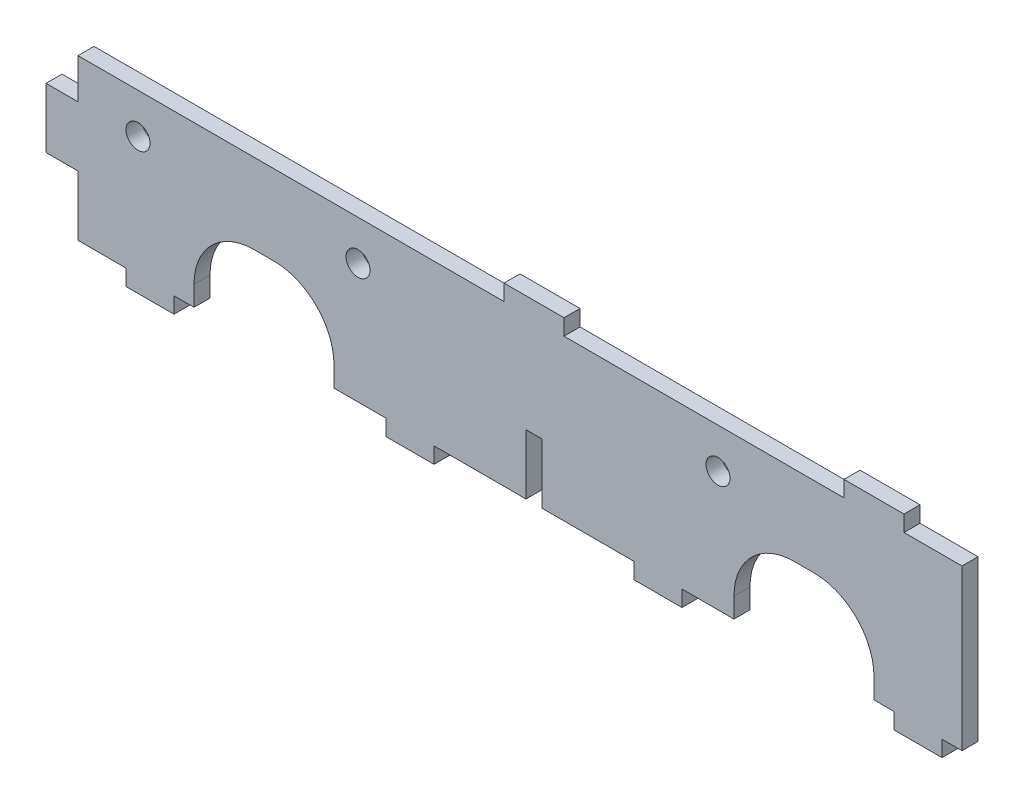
ISO-10303-21;
HEADER;
FILE_DESCRIPTION(('STEP AP214'),'2;1');
FILE_NAME('part.step','',(''),(''),'','','');
FILE_SCHEMA(('AUTOMOTIVE_DESIGN { 1 0 10303 214 1 1 1 1 }'));
ENDSEC;
DATA;
#1=APPLICATION_CONTEXT('core data for automotive mechanical design processes');
#2=APPLICATION_PROTOCOL_DEFINITION('international standard','automotive_design',2000,#1);
#3=PRODUCT_CONTEXT('',#1,'mechanical');
#4=PRODUCT('Part','Part','',(#3));
#5=PRODUCT_RELATED_PRODUCT_CATEGORY('part','',(#4));
#6=PRODUCT_DEFINITION_FORMATION('','',#4);
#7=PRODUCT_DEFINITION_CONTEXT('part definition',#1,'design');
#8=PRODUCT_DEFINITION('design','',#6,#7);
#9=PRODUCT_DEFINITION_SHAPE('','',#8);
#10=(LENGTH_UNIT() NAMED_UNIT(*) SI_UNIT(.MILLI.,.METRE.));
#11=(NAMED_UNIT(*) PLANE_ANGLE_UNIT() SI_UNIT($,.RADIAN.));
#12=(NAMED_UNIT(*) SI_UNIT($,.STERADIAN.) SOLID_ANGLE_UNIT());
#13=UNCERTAINTY_MEASURE_WITH_UNIT(LENGTH_MEASURE(1.E-05),#10,'distance_accuracy_value','');
#14=(GEOMETRIC_REPRESENTATION_CONTEXT(3) GLOBAL_UNCERTAINTY_ASSIGNED_CONTEXT((#13)) GLOBAL_UNIT_ASSIGNED_CONTEXT((#10,
#11,#12)) REPRESENTATION_CONTEXT('',''));
#15=CARTESIAN_POINT('',(0.,0.,0.));
#16=DIRECTION('',(0.,0.,1.));
#17=DIRECTION('',(1.,0.,0.));
#18=AXIS2_PLACEMENT_3D('',#15,#16,#17);
#19=CARTESIAN_POINT('',(70.,5.,2.));
#20=DIRECTION('',(0.,0.,-1.));
#21=DIRECTION('',(-1.,0.,0.));
#22=AXIS2_PLACEMENT_3D('',#19,#20,#21);
#23=PLANE('',#22);
#24=CARTESIAN_POINT('',(-99.,30.,2.));
#25=DIRECTION('',(0.,0.,1.));
#26=DIRECTION('',(1.,0.,0.));
#27=AXIS2_PLACEMENT_3D('',#24,#25,#26);
#28=CIRCLE('',#27,3.00000000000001);
#29=CARTESIAN_POINT('',(-96.,30.,2.));
#30=VERTEX_POINT('',#29);
#31=EDGE_CURVE('E754',#30,#30,#28,.T.);
#32=ORIENTED_EDGE('',*,*,#31,.F.);
#33=EDGE_LOOP('',(#32));
#34=FACE_BOUND('',#33,.T.);
#35=DIRECTION('',(0.,-1.,0.));
#36=VECTOR('',#35,1.);
#37=CARTESIAN_POINT('',(-114.,0.,2.));
#38=LINE('',#37,#36);
#39=CARTESIAN_POINT('',(-114.,15.,2.));
#40=VERTEX_POINT('',#39);
#41=CARTESIAN_POINT('',(-114.,0.,2.));
#42=VERTEX_POINT('',#41);
#43=EDGE_CURVE('E464',#40,#42,#38,.T.);
#44=ORIENTED_EDGE('',*,*,#43,.T.);
#45=DIRECTION('',(1.,0.,0.));
#46=VECTOR('',#45,1.);
#47=CARTESIAN_POINT('',(-114.,0.,2.));
#48=LINE('',#47,#46);
#49=CARTESIAN_POINT('',(-102.,0.,2.));
#50=VERTEX_POINT('',#49);
#51=EDGE_CURVE('E212',#42,#50,#48,.T.);
#52=ORIENTED_EDGE('',*,*,#51,.T.);
#53=DIRECTION('',(0.,-1.,0.));
#54=VECTOR('',#53,1.);
#55=CARTESIAN_POINT('',(-102.,0.,2.));
#56=LINE('',#55,#54);
#57=CARTESIAN_POINT('',(-102.,-4.,2.));
#58=VERTEX_POINT('',#57);
#59=EDGE_CURVE('E599',#50,#58,#56,.T.);
#60=ORIENTED_EDGE('',*,*,#59,.T.);
#61=DIRECTION('',(1.,0.,0.));
#62=VECTOR('',#61,1.);
#63=CARTESIAN_POINT('',(-102.,-4.,2.));
#64=LINE('',#63,#62);
#65=CARTESIAN_POINT('',(-90.,-4.,2.));
#66=VERTEX_POINT('',#65);
#67=EDGE_CURVE('E618',#58,#66,#64,.T.);
#68=ORIENTED_EDGE('',*,*,#67,.T.);
#69=DIRECTION('',(0.,1.,0.));
#70=VECTOR('',#69,1.);
#71=CARTESIAN_POINT('',(-90.,-4.,2.));
#72=LINE('',#71,#70);
#73=CARTESIAN_POINT('',(-90.,0.,2.));
#74=VERTEX_POINT('',#73);
#75=EDGE_CURVE('E615',#66,#74,#72,.T.);
#76=ORIENTED_EDGE('',*,*,#75,.T.);
#77=DIRECTION('',(1.,0.,0.));
#78=VECTOR('',#77,1.);
#79=CARTESIAN_POINT('',(-85.,0.,2.));
#80=LINE('',#79,#78);
#81=CARTESIAN_POINT('',(-85.,0.,2.));
#82=VERTEX_POINT('',#81);
#83=EDGE_CURVE('E617',#74,#82,#80,.T.);
#84=ORIENTED_EDGE('',*,*,#83,.T.);
#85=DIRECTION('',(0.,1.,0.));
#86=VECTOR('',#85,1.);
#87=CARTESIAN_POINT('',(-85.,5.,2.));
#88=LINE('',#87,#86);
#89=CARTESIAN_POINT('',(-85.,5.,2.));
#90=VERTEX_POINT('',#89);
#91=EDGE_CURVE('E620',#82,#90,#88,.T.);
#92=ORIENTED_EDGE('',*,*,#91,.T.);
#93=CARTESIAN_POINT('',(-70.,5.,2.));
#94=DIRECTION('',(0.,0.,-1.));
#95=DIRECTION('',(1.,0.,0.));
#96=AXIS2_PLACEMENT_3D('',#93,#94,#95);
#97=CIRCLE('',#96,15.);
#98=CARTESIAN_POINT('',(-70.,20.,2.));
#99=VERTEX_POINT('',#98);
#100=EDGE_CURVE('E626',#90,#99,#97,.T.);
#101=ORIENTED_EDGE('',*,*,#100,.T.);
#102=DIRECTION('',(1.,0.,0.));
#103=VECTOR('',#102,1.);
#104=CARTESIAN_POINT('',(-65.,20.,2.));
#105=LINE('',#104,#103);
#106=CARTESIAN_POINT('',(-65.,20.,2.));
#107=VERTEX_POINT('',#106);
#108=EDGE_CURVE('E628',#99,#107,#105,.T.);
#109=ORIENTED_EDGE('',*,*,#108,.T.);
#110=CARTESIAN_POINT('',(-65.,5.,2.));
#111=DIRECTION('',(0.,0.,-1.));
#112=DIRECTION('',(1.,0.,0.));
#113=AXIS2_PLACEMENT_3D('',#110,#111,#112);
#114=CIRCLE('',#113,15.);
#115=CARTESIAN_POINT('',(-50.,5.,2.));
#116=VERTEX_POINT('',#115);
#117=EDGE_CURVE('E630',#107,#116,#114,.T.);
#118=ORIENTED_EDGE('',*,*,#117,.T.);
#119=DIRECTION('',(0.,-1.,0.));
#120=VECTOR('',#119,1.);
#121=CARTESIAN_POINT('',(-50.,0.,2.));
#122=LINE('',#121,#120);
#123=CARTESIAN_POINT('',(-50.,0.,2.));
#124=VERTEX_POINT('',#123);
#125=EDGE_CURVE('E632',#116,#124,#122,.T.);
#126=ORIENTED_EDGE('',*,*,#125,.T.);
#127=DIRECTION('',(1.,0.,0.));
#128=VECTOR('',#127,1.);
#129=CARTESIAN_POINT('',(-37.,0.,2.));
#130=LINE('',#129,#128);
#131=CARTESIAN_POINT('',(-37.,0.,2.));
#132=VERTEX_POINT('',#131);
#133=EDGE_CURVE('E634',#124,#132,#130,.T.);
#134=ORIENTED_EDGE('',*,*,#133,.T.);
#135=DIRECTION('',(0.,-1.,0.));
#136=VECTOR('',#135,1.);
#137=CARTESIAN_POINT('',(-37.,0.,2.));
#138=LINE('',#137,#136);
#139=CARTESIAN_POINT('',(-37.,-4.,2.));
#140=VERTEX_POINT('',#139);
#141=EDGE_CURVE('E636',#132,#140,#138,.T.);
#142=ORIENTED_EDGE('',*,*,#141,.T.);
#143=DIRECTION('',(1.,0.,0.));
#144=VECTOR('',#143,1.);
#145=CARTESIAN_POINT('',(-37.,-4.,2.));
#146=LINE('',#145,#144);
#147=CARTESIAN_POINT('',(-25.,-4.,2.));
#148=VERTEX_POINT('',#147);
#149=EDGE_CURVE('E638',#140,#148,#146,.T.);
#150=ORIENTED_EDGE('',*,*,#149,.T.);
#151=DIRECTION('',(0.,1.,0.));
#152=VECTOR('',#151,1.);
#153=CARTESIAN_POINT('',(-25.,0.,2.));
#154=LINE('',#153,#152);
#155=CARTESIAN_POINT('',(-25.,0.,2.));
#156=VERTEX_POINT('',#155);
#157=EDGE_CURVE('E640',#148,#156,#154,.T.);
#158=ORIENTED_EDGE('',*,*,#157,.T.);
#159=DIRECTION('',(1.,0.,0.));
#160=VECTOR('',#159,1.);
#161=CARTESIAN_POINT('',(-25.,0.,2.));
#162=LINE('',#161,#160);
#163=CARTESIAN_POINT('',(-2.,0.,2.));
#164=VERTEX_POINT('',#163);
#165=EDGE_CURVE('E642',#156,#164,#162,.T.);
#166=ORIENTED_EDGE('',*,*,#165,.T.);
#167=DIRECTION('',(0.,1.,0.));
#168=VECTOR('',#167,1.);
#169=CARTESIAN_POINT('',(-2.,0.,2.));
#170=LINE('',#169,#168);
#171=CARTESIAN_POINT('',(-2.,15.,2.));
#172=VERTEX_POINT('',#171);
#173=EDGE_CURVE('E644',#164,#172,#170,.T.);
#174=ORIENTED_EDGE('',*,*,#173,.T.);
#175=DIRECTION('',(1.,0.,0.));
#176=VECTOR('',#175,1.);
#177=CARTESIAN_POINT('',(2.,15.,2.));
#178=LINE('',#177,#176);
#179=CARTESIAN_POINT('',(2.,15.,2.));
#180=VERTEX_POINT('',#179);
#181=EDGE_CURVE('E646',#172,#180,#178,.T.);
#182=ORIENTED_EDGE('',*,*,#181,.T.);
#183=DIRECTION('',(0.,-1.,0.));
#184=VECTOR('',#183,1.);
#185=CARTESIAN_POINT('',(2.,0.,2.));
#186=LINE('',#185,#184);
#187=CARTESIAN_POINT('',(2.,0.,2.));
#188=VERTEX_POINT('',#187);
#189=EDGE_CURVE('E648',#180,#188,#186,.T.);
#190=ORIENTED_EDGE('',*,*,#189,.T.);
#191=DIRECTION('',(1.,0.,0.));
#192=VECTOR('',#191,1.);
#193=CARTESIAN_POINT('',(2.,0.,2.));
#194=LINE('',#193,#192);
#195=CARTESIAN_POINT('',(25.,0.,2.));
#196=VERTEX_POINT('',#195);
#197=EDGE_CURVE('E650',#188,#196,#194,.T.);
#198=ORIENTED_EDGE('',*,*,#197,.T.);
#199=DIRECTION('',(0.,-1.,0.));
#200=VECTOR('',#199,1.);
#201=CARTESIAN_POINT('',(25.,0.,2.));
#202=LINE('',#201,#200);
#203=CARTESIAN_POINT('',(25.,-4.,2.));
#204=VERTEX_POINT('',#203);
#205=EDGE_CURVE('E652',#196,#204,#202,.T.);
#206=ORIENTED_EDGE('',*,*,#205,.T.);
#207=DIRECTION('',(1.,0.,0.));
#208=VECTOR('',#207,1.);
#209=CARTESIAN_POINT('',(25.,-4.,2.));
#210=LINE('',#209,#208);
#211=CARTESIAN_POINT('',(37.,-4.,2.));
#212=VERTEX_POINT('',#211);
#213=EDGE_CURVE('E654',#204,#212,#210,.T.);
#214=ORIENTED_EDGE('',*,*,#213,.T.);
#215=DIRECTION('',(0.,1.,0.));
#216=VECTOR('',#215,1.);
#217=CARTESIAN_POINT('',(37.,0.,2.));
#218=LINE('',#217,#216);
#219=CARTESIAN_POINT('',(37.,0.,2.));
#220=VERTEX_POINT('',#219);
#221=EDGE_CURVE('E656',#212,#220,#218,.T.);
#222=ORIENTED_EDGE('',*,*,#221,.T.);
#223=DIRECTION('',(1.,0.,0.));
#224=VECTOR('',#223,1.);
#225=CARTESIAN_POINT('',(37.,0.,2.));
#226=LINE('',#225,#224);
#227=CARTESIAN_POINT('',(50.,0.,2.));
#228=VERTEX_POINT('',#227);
#229=EDGE_CURVE('E658',#220,#228,#226,.T.);
#230=ORIENTED_EDGE('',*,*,#229,.T.);
#231=DIRECTION('',(0.,1.,0.));
#232=VECTOR('',#231,1.);
#233=CARTESIAN_POINT('',(50.,0.,2.));
#234=LINE('',#233,#232);
#235=CARTESIAN_POINT('',(50.,5.,2.));
#236=VERTEX_POINT('',#235);
#237=EDGE_CURVE('E660',#228,#236,#234,.T.);
#238=ORIENTED_EDGE('',*,*,#237,.T.);
#239=CARTESIAN_POINT('',(65.,5.,2.));
#240=DIRECTION('',(0.,0.,-1.));
#241=DIRECTION('',(-1.,0.,0.));
#242=AXIS2_PLACEMENT_3D('',#239,#240,#241);
#243=CIRCLE('',#242,15.);
#244=CARTESIAN_POINT('',(65.,20.,2.));
#245=VERTEX_POINT('',#244);
#246=EDGE_CURVE('E662',#236,#245,#243,.T.);
#247=ORIENTED_EDGE('',*,*,#246,.T.);
#248=DIRECTION('',(1.,0.,0.));
#249=VECTOR('',#248,1.);
#250=CARTESIAN_POINT('',(65.,20.,2.));
#251=LINE('',#250,#249);
#252=CARTESIAN_POINT('',(70.,20.,2.));
#253=VERTEX_POINT('',#252);
#254=EDGE_CURVE('E664',#245,#253,#251,.T.);
#255=ORIENTED_EDGE('',*,*,#254,.T.);
#256=CARTESIAN_POINT('',(70.,5.,2.));
#257=DIRECTION('',(0.,0.,-1.));
#258=DIRECTION('',(-1.,0.,0.));
#259=AXIS2_PLACEMENT_3D('',#256,#257,#258);
#260=CIRCLE('',#259,15.);
#261=CARTESIAN_POINT('',(85.,5.,2.));
#262=VERTEX_POINT('',#261);
#263=EDGE_CURVE('E666',#253,#262,#260,.T.);
#264=ORIENTED_EDGE('',*,*,#263,.T.);
#265=DIRECTION('',(0.,-1.,0.));
#266=VECTOR('',#265,1.);
#267=CARTESIAN_POINT('',(85.,5.,2.));
#268=LINE('',#267,#266);
#269=CARTESIAN_POINT('',(85.,0.,2.));
#270=VERTEX_POINT('',#269);
#271=EDGE_CURVE('E668',#262,#270,#268,.T.);
#272=ORIENTED_EDGE('',*,*,#271,.T.);
#273=DIRECTION('',(1.,0.,0.));
#274=VECTOR('',#273,1.);
#275=CARTESIAN_POINT('',(85.,0.,2.));
#276=LINE('',#275,#274);
#277=CARTESIAN_POINT('',(90.,0.,2.));
#278=VERTEX_POINT('',#277);
#279=EDGE_CURVE('E670',#270,#278,#276,.T.);
#280=ORIENTED_EDGE('',*,*,#279,.T.);
#281=DIRECTION('',(0.,-1.,0.));
#282=VECTOR('',#281,1.);
#283=CARTESIAN_POINT('',(90.,0.,2.));
#284=LINE('',#283,#282);
#285=CARTESIAN_POINT('',(90.,-4.,2.));
#286=VERTEX_POINT('',#285);
#287=EDGE_CURVE('E672',#278,#286,#284,.T.);
#288=ORIENTED_EDGE('',*,*,#287,.T.);
#289=DIRECTION('',(1.,0.,0.));
#290=VECTOR('',#289,1.);
#291=CARTESIAN_POINT('',(90.,-4.,2.));
#292=LINE('',#291,#290);
#293=CARTESIAN_POINT('',(102.,-4.,2.));
#294=VERTEX_POINT('',#293);
#295=EDGE_CURVE('E674',#286,#294,#292,.T.);
#296=ORIENTED_EDGE('',*,*,#295,.T.);
#297=DIRECTION('',(0.,1.,0.));
#298=VECTOR('',#297,1.);
#299=CARTESIAN_POINT('',(102.,0.,2.));
#300=LINE('',#299,#298);
#301=CARTESIAN_POINT('',(102.,0.,2.));
#302=VERTEX_POINT('',#301);
#303=EDGE_CURVE('E676',#294,#302,#300,.T.);
#304=ORIENTED_EDGE('',*,*,#303,.T.);
#305=DIRECTION('',(1.,0.,0.));
#306=VECTOR('',#305,1.);
#307=CARTESIAN_POINT('',(102.,0.,2.));
#308=LINE('',#307,#306);
#309=CARTESIAN_POINT('',(107.,0.,2.));
#310=VERTEX_POINT('',#309);
#311=EDGE_CURVE('E678',#302,#310,#308,.T.);
#312=ORIENTED_EDGE('',*,*,#311,.T.);
#313=DIRECTION('',(0.,1.,0.));
#314=VECTOR('',#313,1.);
#315=CARTESIAN_POINT('',(107.,0.,2.));
#316=LINE('',#315,#314);
#317=CARTESIAN_POINT('',(107.,40.,2.));
#318=VERTEX_POINT('',#317);
#319=EDGE_CURVE('E680',#310,#318,#316,.T.);
#320=ORIENTED_EDGE('',*,*,#319,.T.);
#321=DIRECTION('',(-1.,0.,0.));
#322=VECTOR('',#321,1.);
#323=CARTESIAN_POINT('',(92.5,40.,2.));
#324=LINE('',#323,#322);
#325=CARTESIAN_POINT('',(92.5,40.,2.));
#326=VERTEX_POINT('',#325);
#327=EDGE_CURVE('E682',#318,#326,#324,.T.);
#328=ORIENTED_EDGE('',*,*,#327,.T.);
#329=DIRECTION('',(0.,1.,0.));
#330=VECTOR('',#329,1.);
#331=CARTESIAN_POINT('',(92.5,40.,2.));
#332=LINE('',#331,#330);
#333=CARTESIAN_POINT('',(92.5,44.,2.));
#334=VERTEX_POINT('',#333);
#335=EDGE_CURVE('E684',#326,#334,#332,.T.);
#336=ORIENTED_EDGE('',*,*,#335,.T.);
#337=DIRECTION('',(-1.,0.,0.));
#338=VECTOR('',#337,1.);
#339=CARTESIAN_POINT('',(92.5,44.,2.));
#340=LINE('',#339,#338);
#341=CARTESIAN_POINT('',(77.5,44.,2.));
#342=VERTEX_POINT('',#341);
#343=EDGE_CURVE('E686',#334,#342,#340,.T.);
#344=ORIENTED_EDGE('',*,*,#343,.T.);
#345=DIRECTION('',(0.,-1.,0.));
#346=VECTOR('',#345,1.);
#347=CARTESIAN_POINT('',(77.5,40.,2.));
#348=LINE('',#347,#346);
#349=CARTESIAN_POINT('',(77.5,40.,2.));
#350=VERTEX_POINT('',#349);
#351=EDGE_CURVE('E688',#342,#350,#348,.T.);
#352=ORIENTED_EDGE('',*,*,#351,.T.);
#353=DIRECTION('',(-1.,0.,0.));
#354=VECTOR('',#353,1.);
#355=CARTESIAN_POINT('',(7.5,40.,2.));
#356=LINE('',#355,#354);
#357=CARTESIAN_POINT('',(7.5,40.,2.));
#358=VERTEX_POINT('',#357);
#359=EDGE_CURVE('E690',#350,#358,#356,.T.);
#360=ORIENTED_EDGE('',*,*,#359,.T.);
#361=DIRECTION('',(0.,1.,0.));
#362=VECTOR('',#361,1.);
#363=CARTESIAN_POINT('',(7.5,40.,2.));
#364=LINE('',#363,#362);
#365=CARTESIAN_POINT('',(7.5,44.,2.));
#366=VERTEX_POINT('',#365);
#367=EDGE_CURVE('E692',#358,#366,#364,.T.);
#368=ORIENTED_EDGE('',*,*,#367,.T.);
#369=DIRECTION('',(-1.,0.,0.));
#370=VECTOR('',#369,1.);
#371=CARTESIAN_POINT('',(7.5,44.,2.));
#372=LINE('',#371,#370);
#373=CARTESIAN_POINT('',(-7.5,44.,2.));
#374=VERTEX_POINT('',#373);
#375=EDGE_CURVE('E694',#366,#374,#372,.T.);
#376=ORIENTED_EDGE('',*,*,#375,.T.);
#377=DIRECTION('',(0.,-1.,0.));
#378=VECTOR('',#377,1.);
#379=CARTESIAN_POINT('',(-7.5,40.,2.));
#380=LINE('',#379,#378);
#381=CARTESIAN_POINT('',(-7.5,40.,2.));
#382=VERTEX_POINT('',#381);
#383=EDGE_CURVE('E696',#374,#382,#380,.T.);
#384=ORIENTED_EDGE('',*,*,#383,.T.);
#385=DIRECTION('',(-1.,0.,0.));
#386=VECTOR('',#385,1.);
#387=CARTESIAN_POINT('',(-114.,40.,2.));
#388=LINE('',#387,#386);
#389=CARTESIAN_POINT('',(-114.,40.,2.));
#390=VERTEX_POINT('',#389);
#391=EDGE_CURVE('E698',#382,#390,#388,.T.);
#392=ORIENTED_EDGE('',*,*,#391,.T.);
#393=DIRECTION('',(0.,-1.,0.));
#394=VECTOR('',#393,1.);
#395=CARTESIAN_POINT('',(-114.,30.,2.));
#396=LINE('',#395,#394);
#397=CARTESIAN_POINT('',(-114.,30.,2.));
#398=VERTEX_POINT('',#397);
#399=EDGE_CURVE('E351',#390,#398,#396,.T.);
#400=ORIENTED_EDGE('',*,*,#399,.T.);
#401=DIRECTION('',(-1.,0.,0.));
#402=VECTOR('',#401,1.);
#403=CARTESIAN_POINT('',(-114.,30.,2.));
#404=LINE('',#403,#402);
#405=CARTESIAN_POINT('',(-122.,30.,2.));
#406=VERTEX_POINT('',#405);
#407=EDGE_CURVE('E345',#398,#406,#404,.T.);
#408=ORIENTED_EDGE('',*,*,#407,.T.);
#409=DIRECTION('',(0.,-1.,0.));
#410=VECTOR('',#409,1.);
#411=CARTESIAN_POINT('',(-122.,30.,2.));
#412=LINE('',#411,#410);
#413=CARTESIAN_POINT('',(-122.,15.,2.));
#414=VERTEX_POINT('',#413);
#415=EDGE_CURVE('E349',#406,#414,#412,.T.);
#416=ORIENTED_EDGE('',*,*,#415,.T.);
#417=DIRECTION('',(1.,0.,0.));
#418=VECTOR('',#417,1.);
#419=CARTESIAN_POINT('',(-114.,15.,2.));
#420=LINE('',#419,#418);
#421=EDGE_CURVE('E49',#414,#40,#420,.T.);
#422=ORIENTED_EDGE('',*,*,#421,.T.);
#423=EDGE_LOOP('',(#44,#52,#60,#68,#76,#84,#92,#101,#109,#118,#126,#134,#142,#150,#158,#166,
#174,#182,#190,#198,#206,#214,#222,#230,#238,#247,#255,#264,#272,#280,#288,#296,#304,#312,#320,
#328,#336,#344,#352,#360,#368,#376,#384,#392,#400,#408,#416,#422));
#424=FACE_BOUND('',#423,.T.);
#425=CARTESIAN_POINT('',(-44.,30.,2.));
#426=DIRECTION('',(0.,0.,1.));
#427=DIRECTION('',(1.,0.,0.));
#428=AXIS2_PLACEMENT_3D('',#425,#426,#427);
#429=CIRCLE('',#428,3.);
#430=CARTESIAN_POINT('',(-41.,30.,2.));
#431=VERTEX_POINT('',#430);
#432=EDGE_CURVE('E373',#431,#431,#429,.T.);
#433=ORIENTED_EDGE('',*,*,#432,.F.);
#434=EDGE_LOOP('',(#433));
#435=FACE_BOUND('',#434,.T.);
#436=CARTESIAN_POINT('',(46.,30.,2.));
#437=DIRECTION('',(0.,0.,1.));
#438=DIRECTION('',(1.,0.,0.));
#439=AXIS2_PLACEMENT_3D('',#436,#437,#438);
#440=CIRCLE('',#439,3.);
#441=CARTESIAN_POINT('',(49.,30.,2.));
#442=VERTEX_POINT('',#441);
#443=EDGE_CURVE('E745',#442,#442,#440,.T.);
#444=ORIENTED_EDGE('',*,*,#443,.F.);
#445=EDGE_LOOP('',(#444));
#446=FACE_BOUND('',#445,.T.);
#447=ADVANCED_FACE('F32',(#34,#424,#435,#446),#23,.F.);
#448=CARTESIAN_POINT('',(70.,5.,-2.));
#449=DIRECTION('',(0.,0.,-1.));
#450=DIRECTION('',(-1.,0.,0.));
#451=AXIS2_PLACEMENT_3D('',#448,#449,#450);
#452=PLANE('',#451);
#453=CARTESIAN_POINT('',(-99.,30.,-2.));
#454=DIRECTION('',(0.,0.,1.));
#455=DIRECTION('',(1.,0.,0.));
#456=AXIS2_PLACEMENT_3D('',#453,#454,#455);
#457=CIRCLE('',#456,3.00000000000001);
#458=CARTESIAN_POINT('',(-96.,30.,-2.));
#459=VERTEX_POINT('',#458);
#460=EDGE_CURVE('E751',#459,#459,#457,.T.);
#461=ORIENTED_EDGE('',*,*,#460,.T.);
#462=EDGE_LOOP('',(#461));
#463=FACE_BOUND('',#462,.T.);
#464=DIRECTION('',(0.,-1.,0.));
#465=VECTOR('',#464,1.);
#466=CARTESIAN_POINT('',(-114.,0.,-2.));
#467=LINE('',#466,#465);
#468=CARTESIAN_POINT('',(-114.,15.,-2.));
#469=VERTEX_POINT('',#468);
#470=CARTESIAN_POINT('',(-114.,0.,-2.));
#471=VERTEX_POINT('',#470);
#472=EDGE_CURVE('E369',#469,#471,#467,.T.);
#473=ORIENTED_EDGE('',*,*,#472,.F.);
#474=DIRECTION('',(1.,0.,0.));
#475=VECTOR('',#474,1.);
#476=CARTESIAN_POINT('',(-114.,15.,-2.));
#477=LINE('',#476,#475);
#478=CARTESIAN_POINT('',(-122.,15.,-2.));
#479=VERTEX_POINT('',#478);
#480=EDGE_CURVE('E204',#479,#469,#477,.T.);
#481=ORIENTED_EDGE('',*,*,#480,.F.);
#482=DIRECTION('',(0.,-1.,0.));
#483=VECTOR('',#482,1.);
#484=CARTESIAN_POINT('',(-122.,30.,-2.));
#485=LINE('',#484,#483);
#486=CARTESIAN_POINT('',(-122.,30.,-2.));
#487=VERTEX_POINT('',#486);
#488=EDGE_CURVE('E198',#487,#479,#485,.T.);
#489=ORIENTED_EDGE('',*,*,#488,.F.);
#490=DIRECTION('',(-1.,0.,0.));
#491=VECTOR('',#490,1.);
#492=CARTESIAN_POINT('',(-114.,30.,-2.));
#493=LINE('',#492,#491);
#494=CARTESIAN_POINT('',(-114.,30.,-2.));
#495=VERTEX_POINT('',#494);
#496=EDGE_CURVE('E359',#495,#487,#493,.T.);
#497=ORIENTED_EDGE('',*,*,#496,.F.);
#498=DIRECTION('',(0.,-1.,0.));
#499=VECTOR('',#498,1.);
#500=CARTESIAN_POINT('',(-114.,30.,-2.));
#501=LINE('',#500,#499);
#502=CARTESIAN_POINT('',(-114.,40.,-2.));
#503=VERTEX_POINT('',#502);
#504=EDGE_CURVE('E459',#503,#495,#501,.T.);
#505=ORIENTED_EDGE('',*,*,#504,.F.);
#506=DIRECTION('',(-1.,0.,0.));
#507=VECTOR('',#506,1.);
#508=CARTESIAN_POINT('',(-114.,40.,-2.));
#509=LINE('',#508,#507);
#510=CARTESIAN_POINT('',(-7.5,40.,-2.));
#511=VERTEX_POINT('',#510);
#512=EDGE_CURVE('E457',#511,#503,#509,.T.);
#513=ORIENTED_EDGE('',*,*,#512,.F.);
#514=DIRECTION('',(0.,-1.,0.));
#515=VECTOR('',#514,1.);
#516=CARTESIAN_POINT('',(-7.5,40.,-2.));
#517=LINE('',#516,#515);
#518=CARTESIAN_POINT('',(-7.5,44.,-2.));
#519=VERTEX_POINT('',#518);
#520=EDGE_CURVE('E455',#519,#511,#517,.T.);
#521=ORIENTED_EDGE('',*,*,#520,.F.);
#522=DIRECTION('',(-1.,0.,0.));
#523=VECTOR('',#522,1.);
#524=CARTESIAN_POINT('',(7.5,44.,-2.));
#525=LINE('',#524,#523);
#526=CARTESIAN_POINT('',(7.5,44.,-2.));
#527=VERTEX_POINT('',#526);
#528=EDGE_CURVE('E453',#527,#519,#525,.T.);
#529=ORIENTED_EDGE('',*,*,#528,.F.);
#530=DIRECTION('',(0.,1.,0.));
#531=VECTOR('',#530,1.);
#532=CARTESIAN_POINT('',(7.5,40.,-2.));
#533=LINE('',#532,#531);
#534=CARTESIAN_POINT('',(7.5,40.,-2.));
#535=VERTEX_POINT('',#534);
#536=EDGE_CURVE('E451',#535,#527,#533,.T.);
#537=ORIENTED_EDGE('',*,*,#536,.F.);
#538=DIRECTION('',(-1.,0.,0.));
#539=VECTOR('',#538,1.);
#540=CARTESIAN_POINT('',(7.5,40.,-2.));
#541=LINE('',#540,#539);
#542=CARTESIAN_POINT('',(77.5,40.,-2.));
#543=VERTEX_POINT('',#542);
#544=EDGE_CURVE('E449',#543,#535,#541,.T.);
#545=ORIENTED_EDGE('',*,*,#544,.F.);
#546=DIRECTION('',(0.,-1.,0.));
#547=VECTOR('',#546,1.);
#548=CARTESIAN_POINT('',(77.5,40.,-2.));
#549=LINE('',#548,#547);
#550=CARTESIAN_POINT('',(77.5,44.,-2.));
#551=VERTEX_POINT('',#550);
#552=EDGE_CURVE('E447',#551,#543,#549,.T.);
#553=ORIENTED_EDGE('',*,*,#552,.F.);
#554=DIRECTION('',(-1.,0.,0.));
#555=VECTOR('',#554,1.);
#556=CARTESIAN_POINT('',(92.5,44.,-2.));
#557=LINE('',#556,#555);
#558=CARTESIAN_POINT('',(92.5,44.,-2.));
#559=VERTEX_POINT('',#558);
#560=EDGE_CURVE('E445',#559,#551,#557,.T.);
#561=ORIENTED_EDGE('',*,*,#560,.F.);
#562=DIRECTION('',(0.,1.,0.));
#563=VECTOR('',#562,1.);
#564=CARTESIAN_POINT('',(92.5,40.,-2.));
#565=LINE('',#564,#563);
#566=CARTESIAN_POINT('',(92.5,40.,-2.));
#567=VERTEX_POINT('',#566);
#568=EDGE_CURVE('E443',#567,#559,#565,.T.);
#569=ORIENTED_EDGE('',*,*,#568,.F.);
#570=DIRECTION('',(-1.,0.,0.));
#571=VECTOR('',#570,1.);
#572=CARTESIAN_POINT('',(92.5,40.,-2.));
#573=LINE('',#572,#571);
#574=CARTESIAN_POINT('',(107.,40.,-2.));
#575=VERTEX_POINT('',#574);
#576=EDGE_CURVE('E441',#575,#567,#573,.T.);
#577=ORIENTED_EDGE('',*,*,#576,.F.);
#578=DIRECTION('',(0.,1.,0.));
#579=VECTOR('',#578,1.);
#580=CARTESIAN_POINT('',(107.,0.,-2.));
#581=LINE('',#580,#579);
#582=CARTESIAN_POINT('',(107.,0.,-2.));
#583=VERTEX_POINT('',#582);
#584=EDGE_CURVE('E439',#583,#575,#581,.T.);
#585=ORIENTED_EDGE('',*,*,#584,.F.);
#586=DIRECTION('',(1.,0.,0.));
#587=VECTOR('',#586,1.);
#588=CARTESIAN_POINT('',(102.,0.,-2.));
#589=LINE('',#588,#587);
#590=CARTESIAN_POINT('',(102.,0.,-2.));
#591=VERTEX_POINT('',#590);
#592=EDGE_CURVE('E437',#591,#583,#589,.T.);
#593=ORIENTED_EDGE('',*,*,#592,.F.);
#594=DIRECTION('',(0.,1.,0.));
#595=VECTOR('',#594,1.);
#596=CARTESIAN_POINT('',(102.,0.,-2.));
#597=LINE('',#596,#595);
#598=CARTESIAN_POINT('',(102.,-4.,-2.));
#599=VERTEX_POINT('',#598);
#600=EDGE_CURVE('E435',#599,#591,#597,.T.);
#601=ORIENTED_EDGE('',*,*,#600,.F.);
#602=DIRECTION('',(1.,0.,0.));
#603=VECTOR('',#602,1.);
#604=CARTESIAN_POINT('',(90.,-4.,-2.));
#605=LINE('',#604,#603);
#606=CARTESIAN_POINT('',(90.,-4.,-2.));
#607=VERTEX_POINT('',#606);
#608=EDGE_CURVE('E433',#607,#599,#605,.T.);
#609=ORIENTED_EDGE('',*,*,#608,.F.);
#610=DIRECTION('',(0.,-1.,0.));
#611=VECTOR('',#610,1.);
#612=CARTESIAN_POINT('',(90.,0.,-2.));
#613=LINE('',#612,#611);
#614=CARTESIAN_POINT('',(90.,0.,-2.));
#615=VERTEX_POINT('',#614);
#616=EDGE_CURVE('E431',#615,#607,#613,.T.);
#617=ORIENTED_EDGE('',*,*,#616,.F.);
#618=DIRECTION('',(1.,0.,0.));
#619=VECTOR('',#618,1.);
#620=CARTESIAN_POINT('',(85.,0.,-2.));
#621=LINE('',#620,#619);
#622=CARTESIAN_POINT('',(85.,0.,-2.));
#623=VERTEX_POINT('',#622);
#624=EDGE_CURVE('E429',#623,#615,#621,.T.);
#625=ORIENTED_EDGE('',*,*,#624,.F.);
#626=DIRECTION('',(0.,-1.,0.));
#627=VECTOR('',#626,1.);
#628=CARTESIAN_POINT('',(85.,5.,-2.));
#629=LINE('',#628,#627);
#630=CARTESIAN_POINT('',(85.,5.,-2.));
#631=VERTEX_POINT('',#630);
#632=EDGE_CURVE('E427',#631,#623,#629,.T.);
#633=ORIENTED_EDGE('',*,*,#632,.F.);
#634=CARTESIAN_POINT('',(70.,5.,-2.));
#635=DIRECTION('',(0.,0.,-1.));
#636=DIRECTION('',(-1.,0.,0.));
#637=AXIS2_PLACEMENT_3D('',#634,#635,#636);
#638=CIRCLE('',#637,15.);
#639=CARTESIAN_POINT('',(70.,20.,-2.));
#640=VERTEX_POINT('',#639);
#641=EDGE_CURVE('E425',#640,#631,#638,.T.);
#642=ORIENTED_EDGE('',*,*,#641,.F.);
#643=DIRECTION('',(1.,0.,0.));
#644=VECTOR('',#643,1.);
#645=CARTESIAN_POINT('',(65.,20.,-2.));
#646=LINE('',#645,#644);
#647=CARTESIAN_POINT('',(65.,20.,-2.));
#648=VERTEX_POINT('',#647);
#649=EDGE_CURVE('E423',#648,#640,#646,.T.);
#650=ORIENTED_EDGE('',*,*,#649,.F.);
#651=CARTESIAN_POINT('',(65.,5.,-2.));
#652=DIRECTION('',(0.,0.,-1.));
#653=DIRECTION('',(-1.,0.,0.));
#654=AXIS2_PLACEMENT_3D('',#651,#652,#653);
#655=CIRCLE('',#654,15.);
#656=CARTESIAN_POINT('',(50.,5.,-2.));
#657=VERTEX_POINT('',#656);
#658=EDGE_CURVE('E421',#657,#648,#655,.T.);
#659=ORIENTED_EDGE('',*,*,#658,.F.);
#660=DIRECTION('',(0.,1.,0.));
#661=VECTOR('',#660,1.);
#662=CARTESIAN_POINT('',(50.,0.,-2.));
#663=LINE('',#662,#661);
#664=CARTESIAN_POINT('',(50.,0.,-2.));
#665=VERTEX_POINT('',#664);
#666=EDGE_CURVE('E419',#665,#657,#663,.T.);
#667=ORIENTED_EDGE('',*,*,#666,.F.);
#668=DIRECTION('',(1.,0.,0.));
#669=VECTOR('',#668,1.);
#670=CARTESIAN_POINT('',(37.,0.,-2.));
#671=LINE('',#670,#669);
#672=CARTESIAN_POINT('',(37.,0.,-2.));
#673=VERTEX_POINT('',#672);
#674=EDGE_CURVE('E417',#673,#665,#671,.T.);
#675=ORIENTED_EDGE('',*,*,#674,.F.);
#676=DIRECTION('',(0.,1.,0.));
#677=VECTOR('',#676,1.);
#678=CARTESIAN_POINT('',(37.,0.,-2.));
#679=LINE('',#678,#677);
#680=CARTESIAN_POINT('',(37.,-4.,-2.));
#681=VERTEX_POINT('',#680);
#682=EDGE_CURVE('E415',#681,#673,#679,.T.);
#683=ORIENTED_EDGE('',*,*,#682,.F.);
#684=DIRECTION('',(1.,0.,0.));
#685=VECTOR('',#684,1.);
#686=CARTESIAN_POINT('',(25.,-4.,-2.));
#687=LINE('',#686,#685);
#688=CARTESIAN_POINT('',(25.,-4.,-2.));
#689=VERTEX_POINT('',#688);
#690=EDGE_CURVE('E413',#689,#681,#687,.T.);
#691=ORIENTED_EDGE('',*,*,#690,.F.);
#692=DIRECTION('',(0.,-1.,0.));
#693=VECTOR('',#692,1.);
#694=CARTESIAN_POINT('',(25.,0.,-2.));
#695=LINE('',#694,#693);
#696=CARTESIAN_POINT('',(25.,0.,-2.));
#697=VERTEX_POINT('',#696);
#698=EDGE_CURVE('E411',#697,#689,#695,.T.);
#699=ORIENTED_EDGE('',*,*,#698,.F.);
#700=DIRECTION('',(1.,0.,0.));
#701=VECTOR('',#700,1.);
#702=CARTESIAN_POINT('',(2.,0.,-2.));
#703=LINE('',#702,#701);
#704=CARTESIAN_POINT('',(2.,0.,-2.));
#705=VERTEX_POINT('',#704);
#706=EDGE_CURVE('E409',#705,#697,#703,.T.);
#707=ORIENTED_EDGE('',*,*,#706,.F.);
#708=DIRECTION('',(0.,-1.,0.));
#709=VECTOR('',#708,1.);
#710=CARTESIAN_POINT('',(2.,0.,-2.));
#711=LINE('',#710,#709);
#712=CARTESIAN_POINT('',(2.,15.,-2.));
#713=VERTEX_POINT('',#712);
#714=EDGE_CURVE('E407',#713,#705,#711,.T.);
#715=ORIENTED_EDGE('',*,*,#714,.F.);
#716=DIRECTION('',(1.,0.,0.));
#717=VECTOR('',#716,1.);
#718=CARTESIAN_POINT('',(2.,15.,-2.));
#719=LINE('',#718,#717);
#720=CARTESIAN_POINT('',(-2.,15.,-2.));
#721=VERTEX_POINT('',#720);
#722=EDGE_CURVE('E405',#721,#713,#719,.T.);
#723=ORIENTED_EDGE('',*,*,#722,.F.);
#724=DIRECTION('',(0.,1.,0.));
#725=VECTOR('',#724,1.);
#726=CARTESIAN_POINT('',(-2.,0.,-2.));
#727=LINE('',#726,#725);
#728=CARTESIAN_POINT('',(-2.,0.,-2.));
#729=VERTEX_POINT('',#728);
#730=EDGE_CURVE('E403',#729,#721,#727,.T.);
#731=ORIENTED_EDGE('',*,*,#730,.F.);
#732=DIRECTION('',(1.,0.,0.));
#733=VECTOR('',#732,1.);
#734=CARTESIAN_POINT('',(-25.,0.,-2.));
#735=LINE('',#734,#733);
#736=CARTESIAN_POINT('',(-25.,0.,-2.));
#737=VERTEX_POINT('',#736);
#738=EDGE_CURVE('E401',#737,#729,#735,.T.);
#739=ORIENTED_EDGE('',*,*,#738,.F.);
#740=DIRECTION('',(0.,1.,0.));
#741=VECTOR('',#740,1.);
#742=CARTESIAN_POINT('',(-25.,0.,-2.));
#743=LINE('',#742,#741);
#744=CARTESIAN_POINT('',(-25.,-4.,-2.));
#745=VERTEX_POINT('',#744);
#746=EDGE_CURVE('E399',#745,#737,#743,.T.);
#747=ORIENTED_EDGE('',*,*,#746,.F.);
#748=DIRECTION('',(1.,0.,0.));
#749=VECTOR('',#748,1.);
#750=CARTESIAN_POINT('',(-37.,-4.,-2.));
#751=LINE('',#750,#749);
#752=CARTESIAN_POINT('',(-37.,-4.,-2.));
#753=VERTEX_POINT('',#752);
#754=EDGE_CURVE('E397',#753,#745,#751,.T.);
#755=ORIENTED_EDGE('',*,*,#754,.F.);
#756=DIRECTION('',(0.,-1.,0.));
#757=VECTOR('',#756,1.);
#758=CARTESIAN_POINT('',(-37.,0.,-2.));
#759=LINE('',#758,#757);
#760=CARTESIAN_POINT('',(-37.,0.,-2.));
#761=VERTEX_POINT('',#760);
#762=EDGE_CURVE('E395',#761,#753,#759,.T.);
#763=ORIENTED_EDGE('',*,*,#762,.F.);
#764=DIRECTION('',(1.,0.,0.));
#765=VECTOR('',#764,1.);
#766=CARTESIAN_POINT('',(-37.,0.,-2.));
#767=LINE('',#766,#765);
#768=CARTESIAN_POINT('',(-50.,0.,-2.));
#769=VERTEX_POINT('',#768);
#770=EDGE_CURVE('E393',#769,#761,#767,.T.);
#771=ORIENTED_EDGE('',*,*,#770,.F.);
#772=DIRECTION('',(0.,-1.,0.));
#773=VECTOR('',#772,1.);
#774=CARTESIAN_POINT('',(-50.,0.,-2.));
#775=LINE('',#774,#773);
#776=CARTESIAN_POINT('',(-50.,5.,-2.));
#777=VERTEX_POINT('',#776);
#778=EDGE_CURVE('E391',#777,#769,#775,.T.);
#779=ORIENTED_EDGE('',*,*,#778,.F.);
#780=CARTESIAN_POINT('',(-65.,5.,-2.));
#781=DIRECTION('',(0.,0.,-1.));
#782=DIRECTION('',(1.,0.,0.));
#783=AXIS2_PLACEMENT_3D('',#780,#781,#782);
#784=CIRCLE('',#783,15.);
#785=CARTESIAN_POINT('',(-65.,20.,-2.));
#786=VERTEX_POINT('',#785);
#787=EDGE_CURVE('E389',#786,#777,#784,.T.);
#788=ORIENTED_EDGE('',*,*,#787,.F.);
#789=DIRECTION('',(1.,0.,0.));
#790=VECTOR('',#789,1.);
#791=CARTESIAN_POINT('',(-65.,20.,-2.));
#792=LINE('',#791,#790);
#793=CARTESIAN_POINT('',(-70.,20.,-2.));
#794=VERTEX_POINT('',#793);
#795=EDGE_CURVE('E387',#794,#786,#792,.T.);
#796=ORIENTED_EDGE('',*,*,#795,.F.);
#797=CARTESIAN_POINT('',(-70.,5.,-2.));
#798=DIRECTION('',(0.,0.,-1.));
#799=DIRECTION('',(1.,0.,0.));
#800=AXIS2_PLACEMENT_3D('',#797,#798,#799);
#801=CIRCLE('',#800,15.);
#802=CARTESIAN_POINT('',(-85.,5.,-2.));
#803=VERTEX_POINT('',#802);
#804=EDGE_CURVE('E385',#803,#794,#801,.T.);
#805=ORIENTED_EDGE('',*,*,#804,.F.);
#806=DIRECTION('',(0.,1.,0.));
#807=VECTOR('',#806,1.);
#808=CARTESIAN_POINT('',(-85.,5.,-2.));
#809=LINE('',#808,#807);
#810=CARTESIAN_POINT('',(-85.,0.,-2.));
#811=VERTEX_POINT('',#810);
#812=EDGE_CURVE('E383',#811,#803,#809,.T.);
#813=ORIENTED_EDGE('',*,*,#812,.F.);
#814=DIRECTION('',(1.,0.,0.));
#815=VECTOR('',#814,1.);
#816=CARTESIAN_POINT('',(-85.,0.,-2.));
#817=LINE('',#816,#815);
#818=CARTESIAN_POINT('',(-90.,0.,-2.));
#819=VERTEX_POINT('',#818);
#820=EDGE_CURVE('E381',#819,#811,#817,.T.);
#821=ORIENTED_EDGE('',*,*,#820,.F.);
#822=DIRECTION('',(0.,1.,0.));
#823=VECTOR('',#822,1.);
#824=CARTESIAN_POINT('',(-90.,-4.,-2.));
#825=LINE('',#824,#823);
#826=CARTESIAN_POINT('',(-90.,-4.,-2.));
#827=VERTEX_POINT('',#826);
#828=EDGE_CURVE('E379',#827,#819,#825,.T.);
#829=ORIENTED_EDGE('',*,*,#828,.F.);
#830=DIRECTION('',(1.,0.,0.));
#831=VECTOR('',#830,1.);
#832=CARTESIAN_POINT('',(-102.,-4.,-2.));
#833=LINE('',#832,#831);
#834=CARTESIAN_POINT('',(-102.,-4.,-2.));
#835=VERTEX_POINT('',#834);
#836=EDGE_CURVE('E377',#835,#827,#833,.T.);
#837=ORIENTED_EDGE('',*,*,#836,.F.);
#838=DIRECTION('',(0.,-1.,0.));
#839=VECTOR('',#838,1.);
#840=CARTESIAN_POINT('',(-102.,0.,-2.));
#841=LINE('',#840,#839);
#842=CARTESIAN_POINT('',(-102.,0.,-2.));
#843=VERTEX_POINT('',#842);
#844=EDGE_CURVE('E375',#843,#835,#841,.T.);
#845=ORIENTED_EDGE('',*,*,#844,.F.);
#846=DIRECTION('',(1.,0.,0.));
#847=VECTOR('',#846,1.);
#848=CARTESIAN_POINT('',(-114.,0.,-2.));
#849=LINE('',#848,#847);
#850=EDGE_CURVE('E372',#471,#843,#849,.T.);
#851=ORIENTED_EDGE('',*,*,#850,.F.);
#852=EDGE_LOOP('',(#473,#481,#489,#497,#505,#513,#521,#529,#537,#545,#553,#561,#569,#577,#585,
#593,#601,#609,#617,#625,#633,#642,#650,#659,#667,#675,#683,#691,#699,#707,#715,#723,#731,#739,
#747,#755,#763,#771,#779,#788,#796,#805,#813,#821,#829,#837,#845,#851));
#853=FACE_BOUND('',#852,.T.);
#854=CARTESIAN_POINT('',(-44.,30.,-2.));
#855=DIRECTION('',(0.,0.,1.));
#856=DIRECTION('',(1.,0.,0.));
#857=AXIS2_PLACEMENT_3D('',#854,#855,#856);
#858=CIRCLE('',#857,3.);
#859=CARTESIAN_POINT('',(-41.,30.,-2.));
#860=VERTEX_POINT('',#859);
#861=EDGE_CURVE('E757',#860,#860,#858,.T.);
#862=ORIENTED_EDGE('',*,*,#861,.T.);
#863=EDGE_LOOP('',(#862));
#864=FACE_BOUND('',#863,.T.);
#865=CARTESIAN_POINT('',(46.,30.,-2.));
#866=DIRECTION('',(0.,0.,1.));
#867=DIRECTION('',(1.,0.,0.));
#868=AXIS2_PLACEMENT_3D('',#865,#866,#867);
#869=CIRCLE('',#868,3.);
#870=CARTESIAN_POINT('',(49.,30.,-2.));
#871=VERTEX_POINT('',#870);
#872=EDGE_CURVE('E748',#871,#871,#869,.T.);
#873=ORIENTED_EDGE('',*,*,#872,.T.);
#874=EDGE_LOOP('',(#873));
#875=FACE_BOUND('',#874,.T.);
#876=ADVANCED_FACE('F603',(#463,#853,#864,#875),#452,.T.);
#877=CARTESIAN_POINT('',(-114.,0.,2.));
#878=DIRECTION('',(1.,0.,0.));
#879=DIRECTION('',(0.,1.,0.));
#880=AXIS2_PLACEMENT_3D('',#877,#878,#879);
#881=PLANE('',#880);
#882=ORIENTED_EDGE('',*,*,#472,.T.);
#883=DIRECTION('',(0.,0.,-1.));
#884=VECTOR('',#883,1.);
#885=CARTESIAN_POINT('',(-114.,0.,2.));
#886=LINE('',#885,#884);
#887=EDGE_CURVE('E11',#42,#471,#886,.T.);
#888=ORIENTED_EDGE('',*,*,#887,.F.);
#889=ORIENTED_EDGE('',*,*,#43,.F.);
#890=DIRECTION('',(0.,0.,-1.));
#891=VECTOR('',#890,1.);
#892=CARTESIAN_POINT('',(-114.,15.,2.));
#893=LINE('',#892,#891);
#894=EDGE_CURVE('E365',#40,#469,#893,.T.);
#895=ORIENTED_EDGE('',*,*,#894,.T.);
#896=EDGE_LOOP('',(#882,#888,#889,#895));
#897=FACE_BOUND('',#896,.T.);
#898=ADVANCED_FACE('F34',(#897),#881,.F.);
#899=CARTESIAN_POINT('',(-114.,0.,2.));
#900=DIRECTION('',(0.,1.,0.));
#901=DIRECTION('',(0.,0.,1.));
#902=AXIS2_PLACEMENT_3D('',#899,#900,#901);
#903=PLANE('',#902);
#904=ORIENTED_EDGE('',*,*,#850,.T.);
#905=DIRECTION('',(0.,0.,-1.));
#906=VECTOR('',#905,1.);
#907=CARTESIAN_POINT('',(-102.,0.,2.));
#908=LINE('',#907,#906);
#909=EDGE_CURVE('E41',#50,#843,#908,.T.);
#910=ORIENTED_EDGE('',*,*,#909,.F.);
#911=ORIENTED_EDGE('',*,*,#51,.F.);
#912=ORIENTED_EDGE('',*,*,#887,.T.);
#913=EDGE_LOOP('',(#904,#910,#911,#912));
#914=FACE_BOUND('',#913,.T.);
#915=ADVANCED_FACE('F1218',(#914),#903,.F.);
#916=CARTESIAN_POINT('',(-102.,0.,2.));
#917=DIRECTION('',(1.,0.,0.));
#918=DIRECTION('',(0.,0.,-1.));
#919=AXIS2_PLACEMENT_3D('',#916,#917,#918);
#920=PLANE('',#919);
#921=ORIENTED_EDGE('',*,*,#844,.T.);
#922=DIRECTION('',(0.,0.,-1.));
#923=VECTOR('',#922,1.);
#924=CARTESIAN_POINT('',(-102.,-4.,2.));
#925=LINE('',#924,#923);
#926=EDGE_CURVE('E591',#58,#835,#925,.T.);
#927=ORIENTED_EDGE('',*,*,#926,.F.);
#928=ORIENTED_EDGE('',*,*,#59,.F.);
#929=ORIENTED_EDGE('',*,*,#909,.T.);
#930=EDGE_LOOP('',(#921,#927,#928,#929));
#931=FACE_BOUND('',#930,.T.);
#932=ADVANCED_FACE('F597',(#931),#920,.F.);
#933=CARTESIAN_POINT('',(-102.,-4.,2.));
#934=DIRECTION('',(0.,1.,0.));
#935=DIRECTION('',(0.,0.,1.));
#936=AXIS2_PLACEMENT_3D('',#933,#934,#935);
#937=PLANE('',#936);
#938=ORIENTED_EDGE('',*,*,#836,.T.);
#939=DIRECTION('',(0.,0.,-1.));
#940=VECTOR('',#939,1.);
#941=CARTESIAN_POINT('',(-90.,-4.,2.));
#942=LINE('',#941,#940);
#943=EDGE_CURVE('E588',#66,#827,#942,.T.);
#944=ORIENTED_EDGE('',*,*,#943,.F.);
#945=ORIENTED_EDGE('',*,*,#67,.F.);
#946=ORIENTED_EDGE('',*,*,#926,.T.);
#947=EDGE_LOOP('',(#938,#944,#945,#946));
#948=FACE_BOUND('',#947,.T.);
#949=ADVANCED_FACE('F609',(#948),#937,.F.);
#950=CARTESIAN_POINT('',(-90.,-4.,2.));
#951=DIRECTION('',(-1.,0.,0.));
#952=DIRECTION('',(0.,0.,1.));
#953=AXIS2_PLACEMENT_3D('',#950,#951,#952);
#954=PLANE('',#953);
#955=ORIENTED_EDGE('',*,*,#828,.T.);
#956=DIRECTION('',(0.,0.,-1.));
#957=VECTOR('',#956,1.);
#958=CARTESIAN_POINT('',(-90.,0.,2.));
#959=LINE('',#958,#957);
#960=EDGE_CURVE('E585',#74,#819,#959,.T.);
#961=ORIENTED_EDGE('',*,*,#960,.F.);
#962=ORIENTED_EDGE('',*,*,#75,.F.);
#963=ORIENTED_EDGE('',*,*,#943,.T.);
#964=EDGE_LOOP('',(#955,#961,#962,#963));
#965=FACE_BOUND('',#964,.T.);
#966=ADVANCED_FACE('F613',(#965),#954,.F.);
#967=CARTESIAN_POINT('',(-85.,0.,2.));
#968=DIRECTION('',(0.,1.,0.));
#969=DIRECTION('',(-1.,0.,0.));
#970=AXIS2_PLACEMENT_3D('',#967,#968,#969);
#971=PLANE('',#970);
#972=ORIENTED_EDGE('',*,*,#820,.T.);
#973=DIRECTION('',(0.,0.,-1.));
#974=VECTOR('',#973,1.);
#975=CARTESIAN_POINT('',(-85.,0.,2.));
#976=LINE('',#975,#974);
#977=EDGE_CURVE('E582',#82,#811,#976,.T.);
#978=ORIENTED_EDGE('',*,*,#977,.F.);
#979=ORIENTED_EDGE('',*,*,#83,.F.);
#980=ORIENTED_EDGE('',*,*,#960,.T.);
#981=EDGE_LOOP('',(#972,#978,#979,#980));
#982=FACE_BOUND('',#981,.T.);
#983=ADVANCED_FACE('F1183',(#982),#971,.F.);
#984=CARTESIAN_POINT('',(-85.,5.,2.));
#985=DIRECTION('',(-1.,0.,0.));
#986=DIRECTION('',(0.,-1.,0.));
#987=AXIS2_PLACEMENT_3D('',#984,#985,#986);
#988=PLANE('',#987);
#989=ORIENTED_EDGE('',*,*,#812,.T.);
#990=DIRECTION('',(0.,0.,-1.));
#991=VECTOR('',#990,1.);
#992=CARTESIAN_POINT('',(-85.,5.,2.));
#993=LINE('',#992,#991);
#994=EDGE_CURVE('E579',#90,#803,#993,.T.);
#995=ORIENTED_EDGE('',*,*,#994,.F.);
#996=ORIENTED_EDGE('',*,*,#91,.F.);
#997=ORIENTED_EDGE('',*,*,#977,.T.);
#998=EDGE_LOOP('',(#989,#995,#996,#997));
#999=FACE_BOUND('',#998,.T.);
#1000=ADVANCED_FACE('F1173',(#999),#988,.F.);
#1001=CARTESIAN_POINT('',(-70.,5.,2.));
#1002=DIRECTION('',(0.,0.,-1.));
#1003=DIRECTION('',(-1.,0.,0.));
#1004=AXIS2_PLACEMENT_3D('',#1001,#1002,#1003);
#1005=CYLINDRICAL_SURFACE('',#1004,15.);
#1006=ORIENTED_EDGE('',*,*,#804,.T.);
#1007=DIRECTION('',(0.,0.,-1.));
#1008=VECTOR('',#1007,1.);
#1009=CARTESIAN_POINT('',(-70.,20.,2.));
#1010=LINE('',#1009,#1008);
#1011=EDGE_CURVE('E576',#99,#794,#1010,.T.);
#1012=ORIENTED_EDGE('',*,*,#1011,.F.);
#1013=ORIENTED_EDGE('',*,*,#100,.F.);
#1014=ORIENTED_EDGE('',*,*,#994,.T.);
#1015=EDGE_LOOP('',(#1006,#1012,#1013,#1014));
#1016=FACE_BOUND('',#1015,.T.);
#1017=ADVANCED_FACE('F1163',(#1016),#1005,.F.);
#1018=CARTESIAN_POINT('',(-65.,20.,2.));
#1019=DIRECTION('',(0.,1.,0.));
#1020=DIRECTION('',(0.,0.,1.));
#1021=AXIS2_PLACEMENT_3D('',#1018,#1019,#1020);
#1022=PLANE('',#1021);
#1023=ORIENTED_EDGE('',*,*,#795,.T.);
#1024=DIRECTION('',(0.,0.,-1.));
#1025=VECTOR('',#1024,1.);
#1026=CARTESIAN_POINT('',(-65.,20.,2.));
#1027=LINE('',#1026,#1025);
#1028=EDGE_CURVE('E573',#107,#786,#1027,.T.);
#1029=ORIENTED_EDGE('',*,*,#1028,.F.);
#1030=ORIENTED_EDGE('',*,*,#108,.F.);
#1031=ORIENTED_EDGE('',*,*,#1011,.T.);
#1032=EDGE_LOOP('',(#1023,#1029,#1030,#1031));
#1033=FACE_BOUND('',#1032,.T.);
#1034=ADVANCED_FACE('F1153',(#1033),#1022,.F.);
#1035=CARTESIAN_POINT('',(-65.,5.,2.));
#1036=DIRECTION('',(0.,0.,-1.));
#1037=DIRECTION('',(-1.,0.,0.));
#1038=AXIS2_PLACEMENT_3D('',#1035,#1036,#1037);
#1039=CYLINDRICAL_SURFACE('',#1038,15.);
#1040=ORIENTED_EDGE('',*,*,#787,.T.);
#1041=DIRECTION('',(0.,0.,-1.));
#1042=VECTOR('',#1041,1.);
#1043=CARTESIAN_POINT('',(-50.,5.,2.));
#1044=LINE('',#1043,#1042);
#1045=EDGE_CURVE('E570',#116,#777,#1044,.T.);
#1046=ORIENTED_EDGE('',*,*,#1045,.F.);
#1047=ORIENTED_EDGE('',*,*,#117,.F.);
#1048=ORIENTED_EDGE('',*,*,#1028,.T.);
#1049=EDGE_LOOP('',(#1040,#1046,#1047,#1048));
#1050=FACE_BOUND('',#1049,.T.);
#1051=ADVANCED_FACE('F1143',(#1050),#1039,.F.);
#1052=CARTESIAN_POINT('',(-50.,0.,2.));
#1053=DIRECTION('',(1.,0.,0.));
#1054=DIRECTION('',(0.,0.,-1.));
#1055=AXIS2_PLACEMENT_3D('',#1052,#1053,#1054);
#1056=PLANE('',#1055);
#1057=ORIENTED_EDGE('',*,*,#778,.T.);
#1058=DIRECTION('',(0.,0.,-1.));
#1059=VECTOR('',#1058,1.);
#1060=CARTESIAN_POINT('',(-50.,0.,2.));
#1061=LINE('',#1060,#1059);
#1062=EDGE_CURVE('E567',#124,#769,#1061,.T.);
#1063=ORIENTED_EDGE('',*,*,#1062,.F.);
#1064=ORIENTED_EDGE('',*,*,#125,.F.);
#1065=ORIENTED_EDGE('',*,*,#1045,.T.);
#1066=EDGE_LOOP('',(#1057,#1063,#1064,#1065));
#1067=FACE_BOUND('',#1066,.T.);
#1068=ADVANCED_FACE('F1133',(#1067),#1056,.F.);
#1069=CARTESIAN_POINT('',(-37.,0.,2.));
#1070=DIRECTION('',(0.,1.,0.));
#1071=DIRECTION('',(-1.,0.,0.));
#1072=AXIS2_PLACEMENT_3D('',#1069,#1070,#1071);
#1073=PLANE('',#1072);
#1074=ORIENTED_EDGE('',*,*,#770,.T.);
#1075=DIRECTION('',(0.,0.,-1.));
#1076=VECTOR('',#1075,1.);
#1077=CARTESIAN_POINT('',(-37.,0.,2.));
#1078=LINE('',#1077,#1076);
#1079=EDGE_CURVE('E564',#132,#761,#1078,.T.);
#1080=ORIENTED_EDGE('',*,*,#1079,.F.);
#1081=ORIENTED_EDGE('',*,*,#133,.F.);
#1082=ORIENTED_EDGE('',*,*,#1062,.T.);
#1083=EDGE_LOOP('',(#1074,#1080,#1081,#1082));
#1084=FACE_BOUND('',#1083,.T.);
#1085=ADVANCED_FACE('F1123',(#1084),#1073,.F.);
#1086=CARTESIAN_POINT('',(-37.,0.,2.));
#1087=DIRECTION('',(1.,0.,0.));
#1088=DIRECTION('',(0.,0.,-1.));
#1089=AXIS2_PLACEMENT_3D('',#1086,#1087,#1088);
#1090=PLANE('',#1089);
#1091=ORIENTED_EDGE('',*,*,#762,.T.);
#1092=DIRECTION('',(0.,0.,-1.));
#1093=VECTOR('',#1092,1.);
#1094=CARTESIAN_POINT('',(-37.,-4.,2.));
#1095=LINE('',#1094,#1093);
#1096=EDGE_CURVE('E561',#140,#753,#1095,.T.);
#1097=ORIENTED_EDGE('',*,*,#1096,.F.);
#1098=ORIENTED_EDGE('',*,*,#141,.F.);
#1099=ORIENTED_EDGE('',*,*,#1079,.T.);
#1100=EDGE_LOOP('',(#1091,#1097,#1098,#1099));
#1101=FACE_BOUND('',#1100,.T.);
#1102=ADVANCED_FACE('F1113',(#1101),#1090,.F.);
#1103=CARTESIAN_POINT('',(-37.,-4.,2.));
#1104=DIRECTION('',(0.,1.,0.));
#1105=DIRECTION('',(0.,0.,1.));
#1106=AXIS2_PLACEMENT_3D('',#1103,#1104,#1105);
#1107=PLANE('',#1106);
#1108=ORIENTED_EDGE('',*,*,#754,.T.);
#1109=DIRECTION('',(0.,0.,-1.));
#1110=VECTOR('',#1109,1.);
#1111=CARTESIAN_POINT('',(-25.,-4.,2.));
#1112=LINE('',#1111,#1110);
#1113=EDGE_CURVE('E558',#148,#745,#1112,.T.);
#1114=ORIENTED_EDGE('',*,*,#1113,.F.);
#1115=ORIENTED_EDGE('',*,*,#149,.F.);
#1116=ORIENTED_EDGE('',*,*,#1096,.T.);
#1117=EDGE_LOOP('',(#1108,#1114,#1115,#1116));
#1118=FACE_BOUND('',#1117,.T.);
#1119=ADVANCED_FACE('F1103',(#1118),#1107,.F.);
#1120=CARTESIAN_POINT('',(-25.,0.,2.));
#1121=DIRECTION('',(-1.,0.,0.));
#1122=DIRECTION('',(0.,0.,1.));
#1123=AXIS2_PLACEMENT_3D('',#1120,#1121,#1122);
#1124=PLANE('',#1123);
#1125=ORIENTED_EDGE('',*,*,#746,.T.);
#1126=DIRECTION('',(0.,0.,-1.));
#1127=VECTOR('',#1126,1.);
#1128=CARTESIAN_POINT('',(-25.,0.,2.));
#1129=LINE('',#1128,#1127);
#1130=EDGE_CURVE('E555',#156,#737,#1129,.T.);
#1131=ORIENTED_EDGE('',*,*,#1130,.F.);
#1132=ORIENTED_EDGE('',*,*,#157,.F.);
#1133=ORIENTED_EDGE('',*,*,#1113,.T.);
#1134=EDGE_LOOP('',(#1125,#1131,#1132,#1133));
#1135=FACE_BOUND('',#1134,.T.);
#1136=ADVANCED_FACE('F1093',(#1135),#1124,.F.);
#1137=CARTESIAN_POINT('',(-25.,0.,2.));
#1138=DIRECTION('',(0.,1.,0.));
#1139=DIRECTION('',(0.,0.,1.));
#1140=AXIS2_PLACEMENT_3D('',#1137,#1138,#1139);
#1141=PLANE('',#1140);
#1142=ORIENTED_EDGE('',*,*,#738,.T.);
#1143=DIRECTION('',(0.,0.,-1.));
#1144=VECTOR('',#1143,1.);
#1145=CARTESIAN_POINT('',(-2.,0.,2.));
#1146=LINE('',#1145,#1144);
#1147=EDGE_CURVE('E552',#164,#729,#1146,.T.);
#1148=ORIENTED_EDGE('',*,*,#1147,.F.);
#1149=ORIENTED_EDGE('',*,*,#165,.F.);
#1150=ORIENTED_EDGE('',*,*,#1130,.T.);
#1151=EDGE_LOOP('',(#1142,#1148,#1149,#1150));
#1152=FACE_BOUND('',#1151,.T.);
#1153=ADVANCED_FACE('F1083',(#1152),#1141,.F.);
#1154=CARTESIAN_POINT('',(-2.,0.,2.));
#1155=DIRECTION('',(-1.,0.,0.));
#1156=DIRECTION('',(0.,0.,1.));
#1157=AXIS2_PLACEMENT_3D('',#1154,#1155,#1156);
#1158=PLANE('',#1157);
#1159=ORIENTED_EDGE('',*,*,#730,.T.);
#1160=DIRECTION('',(0.,0.,-1.));
#1161=VECTOR('',#1160,1.);
#1162=CARTESIAN_POINT('',(-2.,15.,2.));
#1163=LINE('',#1162,#1161);
#1164=EDGE_CURVE('E549',#172,#721,#1163,.T.);
#1165=ORIENTED_EDGE('',*,*,#1164,.F.);
#1166=ORIENTED_EDGE('',*,*,#173,.F.);
#1167=ORIENTED_EDGE('',*,*,#1147,.T.);
#1168=EDGE_LOOP('',(#1159,#1165,#1166,#1167));
#1169=FACE_BOUND('',#1168,.T.);
#1170=ADVANCED_FACE('F1073',(#1169),#1158,.F.);
#1171=CARTESIAN_POINT('',(2.,15.,2.));
#1172=DIRECTION('',(0.,1.,0.));
#1173=DIRECTION('',(0.,0.,1.));
#1174=AXIS2_PLACEMENT_3D('',#1171,#1172,#1173);
#1175=PLANE('',#1174);
#1176=ORIENTED_EDGE('',*,*,#722,.T.);
#1177=DIRECTION('',(0.,0.,-1.));
#1178=VECTOR('',#1177,1.);
#1179=CARTESIAN_POINT('',(2.,15.,2.));
#1180=LINE('',#1179,#1178);
#1181=EDGE_CURVE('E546',#180,#713,#1180,.T.);
#1182=ORIENTED_EDGE('',*,*,#1181,.F.);
#1183=ORIENTED_EDGE('',*,*,#181,.F.);
#1184=ORIENTED_EDGE('',*,*,#1164,.T.);
#1185=EDGE_LOOP('',(#1176,#1182,#1183,#1184));
#1186=FACE_BOUND('',#1185,.T.);
#1187=ADVANCED_FACE('F1063',(#1186),#1175,.F.);
#1188=CARTESIAN_POINT('',(2.,0.,2.));
#1189=DIRECTION('',(1.,0.,0.));
#1190=DIRECTION('',(0.,0.,-1.));
#1191=AXIS2_PLACEMENT_3D('',#1188,#1189,#1190);
#1192=PLANE('',#1191);
#1193=ORIENTED_EDGE('',*,*,#714,.T.);
#1194=DIRECTION('',(0.,0.,-1.));
#1195=VECTOR('',#1194,1.);
#1196=CARTESIAN_POINT('',(2.,0.,2.));
#1197=LINE('',#1196,#1195);
#1198=EDGE_CURVE('E543',#188,#705,#1197,.T.);
#1199=ORIENTED_EDGE('',*,*,#1198,.F.);
#1200=ORIENTED_EDGE('',*,*,#189,.F.);
#1201=ORIENTED_EDGE('',*,*,#1181,.T.);
#1202=EDGE_LOOP('',(#1193,#1199,#1200,#1201));
#1203=FACE_BOUND('',#1202,.T.);
#1204=ADVANCED_FACE('F1053',(#1203),#1192,.F.);
#1205=CARTESIAN_POINT('',(2.,0.,2.));
#1206=DIRECTION('',(0.,1.,0.));
#1207=DIRECTION('',(0.,0.,1.));
#1208=AXIS2_PLACEMENT_3D('',#1205,#1206,#1207);
#1209=PLANE('',#1208);
#1210=ORIENTED_EDGE('',*,*,#706,.T.);
#1211=DIRECTION('',(0.,0.,-1.));
#1212=VECTOR('',#1211,1.);
#1213=CARTESIAN_POINT('',(25.,0.,2.));
#1214=LINE('',#1213,#1212);
#1215=EDGE_CURVE('E540',#196,#697,#1214,.T.);
#1216=ORIENTED_EDGE('',*,*,#1215,.F.);
#1217=ORIENTED_EDGE('',*,*,#197,.F.);
#1218=ORIENTED_EDGE('',*,*,#1198,.T.);
#1219=EDGE_LOOP('',(#1210,#1216,#1217,#1218));
#1220=FACE_BOUND('',#1219,.T.);
#1221=ADVANCED_FACE('F1043',(#1220),#1209,.F.);
#1222=CARTESIAN_POINT('',(25.,0.,2.));
#1223=DIRECTION('',(1.,0.,0.));
#1224=DIRECTION('',(0.,0.,-1.));
#1225=AXIS2_PLACEMENT_3D('',#1222,#1223,#1224);
#1226=PLANE('',#1225);
#1227=ORIENTED_EDGE('',*,*,#698,.T.);
#1228=DIRECTION('',(0.,0.,-1.));
#1229=VECTOR('',#1228,1.);
#1230=CARTESIAN_POINT('',(25.,-4.,2.));
#1231=LINE('',#1230,#1229);
#1232=EDGE_CURVE('E537',#204,#689,#1231,.T.);
#1233=ORIENTED_EDGE('',*,*,#1232,.F.);
#1234=ORIENTED_EDGE('',*,*,#205,.F.);
#1235=ORIENTED_EDGE('',*,*,#1215,.T.);
#1236=EDGE_LOOP('',(#1227,#1233,#1234,#1235));
#1237=FACE_BOUND('',#1236,.T.);
#1238=ADVANCED_FACE('F1033',(#1237),#1226,.F.);
#1239=CARTESIAN_POINT('',(25.,-4.,2.));
#1240=DIRECTION('',(0.,1.,0.));
#1241=DIRECTION('',(0.,0.,1.));
#1242=AXIS2_PLACEMENT_3D('',#1239,#1240,#1241);
#1243=PLANE('',#1242);
#1244=ORIENTED_EDGE('',*,*,#690,.T.);
#1245=DIRECTION('',(0.,0.,-1.));
#1246=VECTOR('',#1245,1.);
#1247=CARTESIAN_POINT('',(37.,-4.,2.));
#1248=LINE('',#1247,#1246);
#1249=EDGE_CURVE('E534',#212,#681,#1248,.T.);
#1250=ORIENTED_EDGE('',*,*,#1249,.F.);
#1251=ORIENTED_EDGE('',*,*,#213,.F.);
#1252=ORIENTED_EDGE('',*,*,#1232,.T.);
#1253=EDGE_LOOP('',(#1244,#1250,#1251,#1252));
#1254=FACE_BOUND('',#1253,.T.);
#1255=ADVANCED_FACE('F1023',(#1254),#1243,.F.);
#1256=CARTESIAN_POINT('',(37.,0.,2.));
#1257=DIRECTION('',(-1.,0.,0.));
#1258=DIRECTION('',(0.,0.,1.));
#1259=AXIS2_PLACEMENT_3D('',#1256,#1257,#1258);
#1260=PLANE('',#1259);
#1261=ORIENTED_EDGE('',*,*,#682,.T.);
#1262=DIRECTION('',(0.,0.,-1.));
#1263=VECTOR('',#1262,1.);
#1264=CARTESIAN_POINT('',(37.,0.,2.));
#1265=LINE('',#1264,#1263);
#1266=EDGE_CURVE('E531',#220,#673,#1265,.T.);
#1267=ORIENTED_EDGE('',*,*,#1266,.F.);
#1268=ORIENTED_EDGE('',*,*,#221,.F.);
#1269=ORIENTED_EDGE('',*,*,#1249,.T.);
#1270=EDGE_LOOP('',(#1261,#1267,#1268,#1269));
#1271=FACE_BOUND('',#1270,.T.);
#1272=ADVANCED_FACE('F1013',(#1271),#1260,.F.);
#1273=CARTESIAN_POINT('',(37.,0.,2.));
#1274=DIRECTION('',(0.,1.,0.));
#1275=DIRECTION('',(-1.,0.,0.));
#1276=AXIS2_PLACEMENT_3D('',#1273,#1274,#1275);
#1277=PLANE('',#1276);
#1278=ORIENTED_EDGE('',*,*,#674,.T.);
#1279=DIRECTION('',(0.,0.,-1.));
#1280=VECTOR('',#1279,1.);
#1281=CARTESIAN_POINT('',(50.,0.,2.));
#1282=LINE('',#1281,#1280);
#1283=EDGE_CURVE('E528',#228,#665,#1282,.T.);
#1284=ORIENTED_EDGE('',*,*,#1283,.F.);
#1285=ORIENTED_EDGE('',*,*,#229,.F.);
#1286=ORIENTED_EDGE('',*,*,#1266,.T.);
#1287=EDGE_LOOP('',(#1278,#1284,#1285,#1286));
#1288=FACE_BOUND('',#1287,.T.);
#1289=ADVANCED_FACE('F1003',(#1288),#1277,.F.);
#1290=CARTESIAN_POINT('',(50.,0.,2.));
#1291=DIRECTION('',(-1.,0.,0.));
#1292=DIRECTION('',(0.,0.,1.));
#1293=AXIS2_PLACEMENT_3D('',#1290,#1291,#1292);
#1294=PLANE('',#1293);
#1295=ORIENTED_EDGE('',*,*,#666,.T.);
#1296=DIRECTION('',(0.,0.,-1.));
#1297=VECTOR('',#1296,1.);
#1298=CARTESIAN_POINT('',(50.,5.,2.));
#1299=LINE('',#1298,#1297);
#1300=EDGE_CURVE('E525',#236,#657,#1299,.T.);
#1301=ORIENTED_EDGE('',*,*,#1300,.F.);
#1302=ORIENTED_EDGE('',*,*,#237,.F.);
#1303=ORIENTED_EDGE('',*,*,#1283,.T.);
#1304=EDGE_LOOP('',(#1295,#1301,#1302,#1303));
#1305=FACE_BOUND('',#1304,.T.);
#1306=ADVANCED_FACE('F993',(#1305),#1294,.F.);
#1307=CARTESIAN_POINT('',(65.,5.,2.));
#1308=DIRECTION('',(0.,0.,-1.));
#1309=DIRECTION('',(-1.,0.,0.));
#1310=AXIS2_PLACEMENT_3D('',#1307,#1308,#1309);
#1311=CYLINDRICAL_SURFACE('',#1310,15.);
#1312=ORIENTED_EDGE('',*,*,#658,.T.);
#1313=DIRECTION('',(0.,0.,-1.));
#1314=VECTOR('',#1313,1.);
#1315=CARTESIAN_POINT('',(65.,20.,2.));
#1316=LINE('',#1315,#1314);
#1317=EDGE_CURVE('E522',#245,#648,#1316,.T.);
#1318=ORIENTED_EDGE('',*,*,#1317,.F.);
#1319=ORIENTED_EDGE('',*,*,#246,.F.);
#1320=ORIENTED_EDGE('',*,*,#1300,.T.);
#1321=EDGE_LOOP('',(#1312,#1318,#1319,#1320));
#1322=FACE_BOUND('',#1321,.T.);
#1323=ADVANCED_FACE('F983',(#1322),#1311,.F.);
#1324=CARTESIAN_POINT('',(65.,20.,2.));
#1325=DIRECTION('',(0.,1.,0.));
#1326=DIRECTION('',(-1.,0.,0.));
#1327=AXIS2_PLACEMENT_3D('',#1324,#1325,#1326);
#1328=PLANE('',#1327);
#1329=ORIENTED_EDGE('',*,*,#649,.T.);
#1330=DIRECTION('',(0.,0.,-1.));
#1331=VECTOR('',#1330,1.);
#1332=CARTESIAN_POINT('',(70.,20.,2.));
#1333=LINE('',#1332,#1331);
#1334=EDGE_CURVE('E519',#253,#640,#1333,.T.);
#1335=ORIENTED_EDGE('',*,*,#1334,.F.);
#1336=ORIENTED_EDGE('',*,*,#254,.F.);
#1337=ORIENTED_EDGE('',*,*,#1317,.T.);
#1338=EDGE_LOOP('',(#1329,#1335,#1336,#1337));
#1339=FACE_BOUND('',#1338,.T.);
#1340=ADVANCED_FACE('F973',(#1339),#1328,.F.);
#1341=CARTESIAN_POINT('',(70.,5.,2.));
#1342=DIRECTION('',(0.,0.,-1.));
#1343=DIRECTION('',(-1.,0.,0.));
#1344=AXIS2_PLACEMENT_3D('',#1341,#1342,#1343);
#1345=CYLINDRICAL_SURFACE('',#1344,15.);
#1346=ORIENTED_EDGE('',*,*,#641,.T.);
#1347=DIRECTION('',(0.,0.,-1.));
#1348=VECTOR('',#1347,1.);
#1349=CARTESIAN_POINT('',(85.,5.,2.));
#1350=LINE('',#1349,#1348);
#1351=EDGE_CURVE('E516',#262,#631,#1350,.T.);
#1352=ORIENTED_EDGE('',*,*,#1351,.F.);
#1353=ORIENTED_EDGE('',*,*,#263,.F.);
#1354=ORIENTED_EDGE('',*,*,#1334,.T.);
#1355=EDGE_LOOP('',(#1346,#1352,#1353,#1354));
#1356=FACE_BOUND('',#1355,.T.);
#1357=ADVANCED_FACE('F963',(#1356),#1345,.F.);
#1358=CARTESIAN_POINT('',(85.,5.,2.));
#1359=DIRECTION('',(1.,0.,0.));
#1360=DIRECTION('',(0.,1.,0.));
#1361=AXIS2_PLACEMENT_3D('',#1358,#1359,#1360);
#1362=PLANE('',#1361);
#1363=ORIENTED_EDGE('',*,*,#632,.T.);
#1364=DIRECTION('',(0.,0.,-1.));
#1365=VECTOR('',#1364,1.);
#1366=CARTESIAN_POINT('',(85.,0.,2.));
#1367=LINE('',#1366,#1365);
#1368=EDGE_CURVE('E513',#270,#623,#1367,.T.);
#1369=ORIENTED_EDGE('',*,*,#1368,.F.);
#1370=ORIENTED_EDGE('',*,*,#271,.F.);
#1371=ORIENTED_EDGE('',*,*,#1351,.T.);
#1372=EDGE_LOOP('',(#1363,#1369,#1370,#1371));
#1373=FACE_BOUND('',#1372,.T.);
#1374=ADVANCED_FACE('F953',(#1373),#1362,.F.);
#1375=CARTESIAN_POINT('',(85.,0.,2.));
#1376=DIRECTION('',(0.,1.,0.));
#1377=DIRECTION('',(-1.,0.,0.));
#1378=AXIS2_PLACEMENT_3D('',#1375,#1376,#1377);
#1379=PLANE('',#1378);
#1380=ORIENTED_EDGE('',*,*,#624,.T.);
#1381=DIRECTION('',(0.,0.,-1.));
#1382=VECTOR('',#1381,1.);
#1383=CARTESIAN_POINT('',(90.,0.,2.));
#1384=LINE('',#1383,#1382);
#1385=EDGE_CURVE('E510',#278,#615,#1384,.T.);
#1386=ORIENTED_EDGE('',*,*,#1385,.F.);
#1387=ORIENTED_EDGE('',*,*,#279,.F.);
#1388=ORIENTED_EDGE('',*,*,#1368,.T.);
#1389=EDGE_LOOP('',(#1380,#1386,#1387,#1388));
#1390=FACE_BOUND('',#1389,.T.);
#1391=ADVANCED_FACE('F943',(#1390),#1379,.F.);
#1392=CARTESIAN_POINT('',(90.,0.,2.));
#1393=DIRECTION('',(1.,0.,0.));
#1394=DIRECTION('',(0.,0.,-1.));
#1395=AXIS2_PLACEMENT_3D('',#1392,#1393,#1394);
#1396=PLANE('',#1395);
#1397=ORIENTED_EDGE('',*,*,#616,.T.);
#1398=DIRECTION('',(0.,0.,-1.));
#1399=VECTOR('',#1398,1.);
#1400=CARTESIAN_POINT('',(90.,-4.,2.));
#1401=LINE('',#1400,#1399);
#1402=EDGE_CURVE('E507',#286,#607,#1401,.T.);
#1403=ORIENTED_EDGE('',*,*,#1402,.F.);
#1404=ORIENTED_EDGE('',*,*,#287,.F.);
#1405=ORIENTED_EDGE('',*,*,#1385,.T.);
#1406=EDGE_LOOP('',(#1397,#1403,#1404,#1405));
#1407=FACE_BOUND('',#1406,.T.);
#1408=ADVANCED_FACE('F933',(#1407),#1396,.F.);
#1409=CARTESIAN_POINT('',(90.,-4.,2.));
#1410=DIRECTION('',(0.,1.,0.));
#1411=DIRECTION('',(0.,0.,1.));
#1412=AXIS2_PLACEMENT_3D('',#1409,#1410,#1411);
#1413=PLANE('',#1412);
#1414=ORIENTED_EDGE('',*,*,#608,.T.);
#1415=DIRECTION('',(0.,0.,-1.));
#1416=VECTOR('',#1415,1.);
#1417=CARTESIAN_POINT('',(102.,-4.,2.));
#1418=LINE('',#1417,#1416);
#1419=EDGE_CURVE('E504',#294,#599,#1418,.T.);
#1420=ORIENTED_EDGE('',*,*,#1419,.F.);
#1421=ORIENTED_EDGE('',*,*,#295,.F.);
#1422=ORIENTED_EDGE('',*,*,#1402,.T.);
#1423=EDGE_LOOP('',(#1414,#1420,#1421,#1422));
#1424=FACE_BOUND('',#1423,.T.);
#1425=ADVANCED_FACE('F923',(#1424),#1413,.F.);
#1426=CARTESIAN_POINT('',(102.,0.,2.));
#1427=DIRECTION('',(-1.,0.,0.));
#1428=DIRECTION('',(0.,0.,1.));
#1429=AXIS2_PLACEMENT_3D('',#1426,#1427,#1428);
#1430=PLANE('',#1429);
#1431=ORIENTED_EDGE('',*,*,#600,.T.);
#1432=DIRECTION('',(0.,0.,-1.));
#1433=VECTOR('',#1432,1.);
#1434=CARTESIAN_POINT('',(102.,0.,2.));
#1435=LINE('',#1434,#1433);
#1436=EDGE_CURVE('E501',#302,#591,#1435,.T.);
#1437=ORIENTED_EDGE('',*,*,#1436,.F.);
#1438=ORIENTED_EDGE('',*,*,#303,.F.);
#1439=ORIENTED_EDGE('',*,*,#1419,.T.);
#1440=EDGE_LOOP('',(#1431,#1437,#1438,#1439));
#1441=FACE_BOUND('',#1440,.T.);
#1442=ADVANCED_FACE('F913',(#1441),#1430,.F.);
#1443=CARTESIAN_POINT('',(102.,0.,2.));
#1444=DIRECTION('',(0.,1.,0.));
#1445=DIRECTION('',(0.,0.,1.));
#1446=AXIS2_PLACEMENT_3D('',#1443,#1444,#1445);
#1447=PLANE('',#1446);
#1448=ORIENTED_EDGE('',*,*,#592,.T.);
#1449=DIRECTION('',(0.,0.,-1.));
#1450=VECTOR('',#1449,1.);
#1451=CARTESIAN_POINT('',(107.,0.,2.));
#1452=LINE('',#1451,#1450);
#1453=EDGE_CURVE('E498',#310,#583,#1452,.T.);
#1454=ORIENTED_EDGE('',*,*,#1453,.F.);
#1455=ORIENTED_EDGE('',*,*,#311,.F.);
#1456=ORIENTED_EDGE('',*,*,#1436,.T.);
#1457=EDGE_LOOP('',(#1448,#1454,#1455,#1456));
#1458=FACE_BOUND('',#1457,.T.);
#1459=ADVANCED_FACE('F903',(#1458),#1447,.F.);
#1460=CARTESIAN_POINT('',(107.,0.,2.));
#1461=DIRECTION('',(-1.,0.,0.));
#1462=DIRECTION('',(0.,0.,1.));
#1463=AXIS2_PLACEMENT_3D('',#1460,#1461,#1462);
#1464=PLANE('',#1463);
#1465=ORIENTED_EDGE('',*,*,#584,.T.);
#1466=DIRECTION('',(0.,0.,-1.));
#1467=VECTOR('',#1466,1.);
#1468=CARTESIAN_POINT('',(107.,40.,2.));
#1469=LINE('',#1468,#1467);
#1470=EDGE_CURVE('E495',#318,#575,#1469,.T.);
#1471=ORIENTED_EDGE('',*,*,#1470,.F.);
#1472=ORIENTED_EDGE('',*,*,#319,.F.);
#1473=ORIENTED_EDGE('',*,*,#1453,.T.);
#1474=EDGE_LOOP('',(#1465,#1471,#1472,#1473));
#1475=FACE_BOUND('',#1474,.T.);
#1476=ADVANCED_FACE('F893',(#1475),#1464,.F.);
#1477=CARTESIAN_POINT('',(92.5,40.,2.));
#1478=DIRECTION('',(0.,-1.,0.));
#1479=DIRECTION('',(0.,0.,-1.));
#1480=AXIS2_PLACEMENT_3D('',#1477,#1478,#1479);
#1481=PLANE('',#1480);
#1482=ORIENTED_EDGE('',*,*,#576,.T.);
#1483=DIRECTION('',(0.,0.,-1.));
#1484=VECTOR('',#1483,1.);
#1485=CARTESIAN_POINT('',(92.5,40.,2.));
#1486=LINE('',#1485,#1484);
#1487=EDGE_CURVE('E492',#326,#567,#1486,.T.);
#1488=ORIENTED_EDGE('',*,*,#1487,.F.);
#1489=ORIENTED_EDGE('',*,*,#327,.F.);
#1490=ORIENTED_EDGE('',*,*,#1470,.T.);
#1491=EDGE_LOOP('',(#1482,#1488,#1489,#1490));
#1492=FACE_BOUND('',#1491,.T.);
#1493=ADVANCED_FACE('F883',(#1492),#1481,.F.);
#1494=CARTESIAN_POINT('',(92.5,40.,2.));
#1495=DIRECTION('',(-1.,0.,0.));
#1496=DIRECTION('',(0.,0.,1.));
#1497=AXIS2_PLACEMENT_3D('',#1494,#1495,#1496);
#1498=PLANE('',#1497);
#1499=ORIENTED_EDGE('',*,*,#568,.T.);
#1500=DIRECTION('',(0.,0.,-1.));
#1501=VECTOR('',#1500,1.);
#1502=CARTESIAN_POINT('',(92.5,44.,2.));
#1503=LINE('',#1502,#1501);
#1504=EDGE_CURVE('E489',#334,#559,#1503,.T.);
#1505=ORIENTED_EDGE('',*,*,#1504,.F.);
#1506=ORIENTED_EDGE('',*,*,#335,.F.);
#1507=ORIENTED_EDGE('',*,*,#1487,.T.);
#1508=EDGE_LOOP('',(#1499,#1505,#1506,#1507));
#1509=FACE_BOUND('',#1508,.T.);
#1510=ADVANCED_FACE('F873',(#1509),#1498,.F.);
#1511=CARTESIAN_POINT('',(92.5,44.,2.));
#1512=DIRECTION('',(0.,-1.,0.));
#1513=DIRECTION('',(1.,0.,0.));
#1514=AXIS2_PLACEMENT_3D('',#1511,#1512,#1513);
#1515=PLANE('',#1514);
#1516=ORIENTED_EDGE('',*,*,#560,.T.);
#1517=DIRECTION('',(0.,0.,-1.));
#1518=VECTOR('',#1517,1.);
#1519=CARTESIAN_POINT('',(77.5,44.,2.));
#1520=LINE('',#1519,#1518);
#1521=EDGE_CURVE('E486',#342,#551,#1520,.T.);
#1522=ORIENTED_EDGE('',*,*,#1521,.F.);
#1523=ORIENTED_EDGE('',*,*,#343,.F.);
#1524=ORIENTED_EDGE('',*,*,#1504,.T.);
#1525=EDGE_LOOP('',(#1516,#1522,#1523,#1524));
#1526=FACE_BOUND('',#1525,.T.);
#1527=ADVANCED_FACE('F863',(#1526),#1515,.F.);
#1528=CARTESIAN_POINT('',(77.5,40.,2.));
#1529=DIRECTION('',(1.,0.,0.));
#1530=DIRECTION('',(0.,0.,-1.));
#1531=AXIS2_PLACEMENT_3D('',#1528,#1529,#1530);
#1532=PLANE('',#1531);
#1533=ORIENTED_EDGE('',*,*,#552,.T.);
#1534=DIRECTION('',(0.,0.,-1.));
#1535=VECTOR('',#1534,1.);
#1536=CARTESIAN_POINT('',(77.5,40.,2.));
#1537=LINE('',#1536,#1535);
#1538=EDGE_CURVE('E483',#350,#543,#1537,.T.);
#1539=ORIENTED_EDGE('',*,*,#1538,.F.);
#1540=ORIENTED_EDGE('',*,*,#351,.F.);
#1541=ORIENTED_EDGE('',*,*,#1521,.T.);
#1542=EDGE_LOOP('',(#1533,#1539,#1540,#1541));
#1543=FACE_BOUND('',#1542,.T.);
#1544=ADVANCED_FACE('F853',(#1543),#1532,.F.);
#1545=CARTESIAN_POINT('',(7.5,40.,2.));
#1546=DIRECTION('',(0.,-1.,0.));
#1547=DIRECTION('',(0.,0.,-1.));
#1548=AXIS2_PLACEMENT_3D('',#1545,#1546,#1547);
#1549=PLANE('',#1548);
#1550=ORIENTED_EDGE('',*,*,#544,.T.);
#1551=DIRECTION('',(0.,0.,-1.));
#1552=VECTOR('',#1551,1.);
#1553=CARTESIAN_POINT('',(7.5,40.,2.));
#1554=LINE('',#1553,#1552);
#1555=EDGE_CURVE('E480',#358,#535,#1554,.T.);
#1556=ORIENTED_EDGE('',*,*,#1555,.F.);
#1557=ORIENTED_EDGE('',*,*,#359,.F.);
#1558=ORIENTED_EDGE('',*,*,#1538,.T.);
#1559=EDGE_LOOP('',(#1550,#1556,#1557,#1558));
#1560=FACE_BOUND('',#1559,.T.);
#1561=ADVANCED_FACE('F843',(#1560),#1549,.F.);
#1562=CARTESIAN_POINT('',(7.5,40.,2.));
#1563=DIRECTION('',(-1.,0.,0.));
#1564=DIRECTION('',(0.,0.,1.));
#1565=AXIS2_PLACEMENT_3D('',#1562,#1563,#1564);
#1566=PLANE('',#1565);
#1567=ORIENTED_EDGE('',*,*,#536,.T.);
#1568=DIRECTION('',(0.,0.,-1.));
#1569=VECTOR('',#1568,1.);
#1570=CARTESIAN_POINT('',(7.5,44.,2.));
#1571=LINE('',#1570,#1569);
#1572=EDGE_CURVE('E477',#366,#527,#1571,.T.);
#1573=ORIENTED_EDGE('',*,*,#1572,.F.);
#1574=ORIENTED_EDGE('',*,*,#367,.F.);
#1575=ORIENTED_EDGE('',*,*,#1555,.T.);
#1576=EDGE_LOOP('',(#1567,#1573,#1574,#1575));
#1577=FACE_BOUND('',#1576,.T.);
#1578=ADVANCED_FACE('F833',(#1577),#1566,.F.);
#1579=CARTESIAN_POINT('',(7.5,44.,2.));
#1580=DIRECTION('',(0.,-1.,0.));
#1581=DIRECTION('',(1.,0.,0.));
#1582=AXIS2_PLACEMENT_3D('',#1579,#1580,#1581);
#1583=PLANE('',#1582);
#1584=ORIENTED_EDGE('',*,*,#528,.T.);
#1585=DIRECTION('',(0.,0.,-1.));
#1586=VECTOR('',#1585,1.);
#1587=CARTESIAN_POINT('',(-7.5,44.,2.));
#1588=LINE('',#1587,#1586);
#1589=EDGE_CURVE('E474',#374,#519,#1588,.T.);
#1590=ORIENTED_EDGE('',*,*,#1589,.F.);
#1591=ORIENTED_EDGE('',*,*,#375,.F.);
#1592=ORIENTED_EDGE('',*,*,#1572,.T.);
#1593=EDGE_LOOP('',(#1584,#1590,#1591,#1592));
#1594=FACE_BOUND('',#1593,.T.);
#1595=ADVANCED_FACE('F823',(#1594),#1583,.F.);
#1596=CARTESIAN_POINT('',(-7.5,40.,2.));
#1597=DIRECTION('',(1.,0.,0.));
#1598=DIRECTION('',(0.,0.,-1.));
#1599=AXIS2_PLACEMENT_3D('',#1596,#1597,#1598);
#1600=PLANE('',#1599);
#1601=ORIENTED_EDGE('',*,*,#520,.T.);
#1602=DIRECTION('',(0.,0.,-1.));
#1603=VECTOR('',#1602,1.);
#1604=CARTESIAN_POINT('',(-7.5,40.,2.));
#1605=LINE('',#1604,#1603);
#1606=EDGE_CURVE('E471',#382,#511,#1605,.T.);
#1607=ORIENTED_EDGE('',*,*,#1606,.F.);
#1608=ORIENTED_EDGE('',*,*,#383,.F.);
#1609=ORIENTED_EDGE('',*,*,#1589,.T.);
#1610=EDGE_LOOP('',(#1601,#1607,#1608,#1609));
#1611=FACE_BOUND('',#1610,.T.);
#1612=ADVANCED_FACE('F814',(#1611),#1600,.F.);
#1613=CARTESIAN_POINT('',(-114.,40.,2.));
#1614=DIRECTION('',(0.,-1.,0.));
#1615=DIRECTION('',(0.,0.,-1.));
#1616=AXIS2_PLACEMENT_3D('',#1613,#1614,#1615);
#1617=PLANE('',#1616);
#1618=ORIENTED_EDGE('',*,*,#512,.T.);
#1619=DIRECTION('',(0.,0.,-1.));
#1620=VECTOR('',#1619,1.);
#1621=CARTESIAN_POINT('',(-114.,40.,2.));
#1622=LINE('',#1621,#1620);
#1623=EDGE_CURVE('E468',#390,#503,#1622,.T.);
#1624=ORIENTED_EDGE('',*,*,#1623,.F.);
#1625=ORIENTED_EDGE('',*,*,#391,.F.);
#1626=ORIENTED_EDGE('',*,*,#1606,.T.);
#1627=EDGE_LOOP('',(#1618,#1624,#1625,#1626));
#1628=FACE_BOUND('',#1627,.T.);
#1629=ADVANCED_FACE('F704',(#1628),#1617,.F.);
#1630=CARTESIAN_POINT('',(-114.,30.,2.));
#1631=DIRECTION('',(1.,0.,0.));
#1632=DIRECTION('',(0.,0.,-1.));
#1633=AXIS2_PLACEMENT_3D('',#1630,#1631,#1632);
#1634=PLANE('',#1633);
#1635=ORIENTED_EDGE('',*,*,#504,.T.);
#1636=DIRECTION('',(0.,0.,-1.));
#1637=VECTOR('',#1636,1.);
#1638=CARTESIAN_POINT('',(-114.,30.,2.));
#1639=LINE('',#1638,#1637);
#1640=EDGE_CURVE('E360',#398,#495,#1639,.T.);
#1641=ORIENTED_EDGE('',*,*,#1640,.F.);
#1642=ORIENTED_EDGE('',*,*,#399,.F.);
#1643=ORIENTED_EDGE('',*,*,#1623,.T.);
#1644=EDGE_LOOP('',(#1635,#1641,#1642,#1643));
#1645=FACE_BOUND('',#1644,.T.);
#1646=ADVANCED_FACE('F708',(#1645),#1634,.F.);
#1647=CARTESIAN_POINT('',(-114.,30.,2.));
#1648=DIRECTION('',(0.,-1.,0.));
#1649=DIRECTION('',(1.,0.,0.));
#1650=AXIS2_PLACEMENT_3D('',#1647,#1648,#1649);
#1651=PLANE('',#1650);
#1652=ORIENTED_EDGE('',*,*,#496,.T.);
#1653=DIRECTION('',(0.,0.,-1.));
#1654=VECTOR('',#1653,1.);
#1655=CARTESIAN_POINT('',(-122.,30.,2.));
#1656=LINE('',#1655,#1654);
#1657=EDGE_CURVE('E356',#406,#487,#1656,.T.);
#1658=ORIENTED_EDGE('',*,*,#1657,.F.);
#1659=ORIENTED_EDGE('',*,*,#407,.F.);
#1660=ORIENTED_EDGE('',*,*,#1640,.T.);
#1661=EDGE_LOOP('',(#1652,#1658,#1659,#1660));
#1662=FACE_BOUND('',#1661,.T.);
#1663=ADVANCED_FACE('F357',(#1662),#1651,.F.);
#1664=CARTESIAN_POINT('',(-122.,30.,2.));
#1665=DIRECTION('',(1.,0.,0.));
#1666=DIRECTION('',(0.,1.,0.));
#1667=AXIS2_PLACEMENT_3D('',#1664,#1665,#1666);
#1668=PLANE('',#1667);
#1669=ORIENTED_EDGE('',*,*,#488,.T.);
#1670=DIRECTION('',(0.,0.,-1.));
#1671=VECTOR('',#1670,1.);
#1672=CARTESIAN_POINT('',(-122.,15.,2.));
#1673=LINE('',#1672,#1671);
#1674=EDGE_CURVE('E361',#414,#479,#1673,.T.);
#1675=ORIENTED_EDGE('',*,*,#1674,.F.);
#1676=ORIENTED_EDGE('',*,*,#415,.F.);
#1677=ORIENTED_EDGE('',*,*,#1657,.T.);
#1678=EDGE_LOOP('',(#1669,#1675,#1676,#1677));
#1679=FACE_BOUND('',#1678,.T.);
#1680=ADVANCED_FACE('F363',(#1679),#1668,.F.);
#1681=CARTESIAN_POINT('',(-114.,15.,2.));
#1682=DIRECTION('',(0.,1.,0.));
#1683=DIRECTION('',(-1.,0.,0.));
#1684=AXIS2_PLACEMENT_3D('',#1681,#1682,#1683);
#1685=PLANE('',#1684);
#1686=ORIENTED_EDGE('',*,*,#480,.T.);
#1687=ORIENTED_EDGE('',*,*,#894,.F.);
#1688=ORIENTED_EDGE('',*,*,#421,.F.);
#1689=ORIENTED_EDGE('',*,*,#1674,.T.);
#1690=EDGE_LOOP('',(#1686,#1687,#1688,#1689));
#1691=FACE_BOUND('',#1690,.T.);
#1692=ADVANCED_FACE('F712',(#1691),#1685,.F.);
#1693=CARTESIAN_POINT('',(-44.,30.,2.));
#1694=DIRECTION('',(0.,0.,-1.));
#1695=DIRECTION('',(-1.,0.,0.));
#1696=AXIS2_PLACEMENT_3D('',#1693,#1694,#1695);
#1697=CYLINDRICAL_SURFACE('',#1696,3.);
#1698=ORIENTED_EDGE('',*,*,#432,.T.);
#1699=EDGE_LOOP('',(#1698));
#1700=FACE_BOUND('',#1699,.T.);
#1701=ORIENTED_EDGE('',*,*,#861,.F.);
#1702=EDGE_LOOP('',(#1701));
#1703=FACE_BOUND('',#1702,.T.);
#1704=ADVANCED_FACE('F714',(#1700,#1703),#1697,.F.);
#1705=CARTESIAN_POINT('',(-99.,30.,2.));
#1706=DIRECTION('',(0.,0.,-1.));
#1707=DIRECTION('',(-1.,0.,0.));
#1708=AXIS2_PLACEMENT_3D('',#1705,#1706,#1707);
#1709=CYLINDRICAL_SURFACE('',#1708,3.00000000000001);
#1710=ORIENTED_EDGE('',*,*,#31,.T.);
#1711=EDGE_LOOP('',(#1710));
#1712=FACE_BOUND('',#1711,.T.);
#1713=ORIENTED_EDGE('',*,*,#460,.F.);
#1714=EDGE_LOOP('',(#1713));
#1715=FACE_BOUND('',#1714,.T.);
#1716=ADVANCED_FACE('F720',(#1712,#1715),#1709,.F.);
#1717=CARTESIAN_POINT('',(46.,30.,2.));
#1718=DIRECTION('',(0.,0.,-1.));
#1719=DIRECTION('',(-1.,0.,0.));
#1720=AXIS2_PLACEMENT_3D('',#1717,#1718,#1719);
#1721=CYLINDRICAL_SURFACE('',#1720,3.);
#1722=ORIENTED_EDGE('',*,*,#443,.T.);
#1723=EDGE_LOOP('',(#1722));
#1724=FACE_BOUND('',#1723,.T.);
#1725=ORIENTED_EDGE('',*,*,#872,.F.);
#1726=EDGE_LOOP('',(#1725));
#1727=FACE_BOUND('',#1726,.T.);
#1728=ADVANCED_FACE('F736',(#1724,#1727),#1721,.F.);
#1729=CLOSED_SHELL('',(#447,#876,#898,#915,#932,#949,#966,#983,#1000,#1017,#1034,#1051,#1068,
#1085,#1102,#1119,#1136,#1153,#1170,#1187,#1204,#1221,#1238,#1255,#1272,#1289,#1306,#1323,#1340,
#1357,#1374,#1391,#1408,#1425,#1442,#1459,#1476,#1493,#1510,#1527,#1544,#1561,#1578,#1595,#1612,
#1629,#1646,#1663,#1680,#1692,#1704,#1716,#1728));
#1730=MANIFOLD_SOLID_BREP('B2',#1729);
#1731=ADVANCED_BREP_SHAPE_REPRESENTATION('',(#18,#1730),#14);
#1732=SHAPE_DEFINITION_REPRESENTATION(#9,#1731);
ENDSEC;
END-ISO-10303-21;
